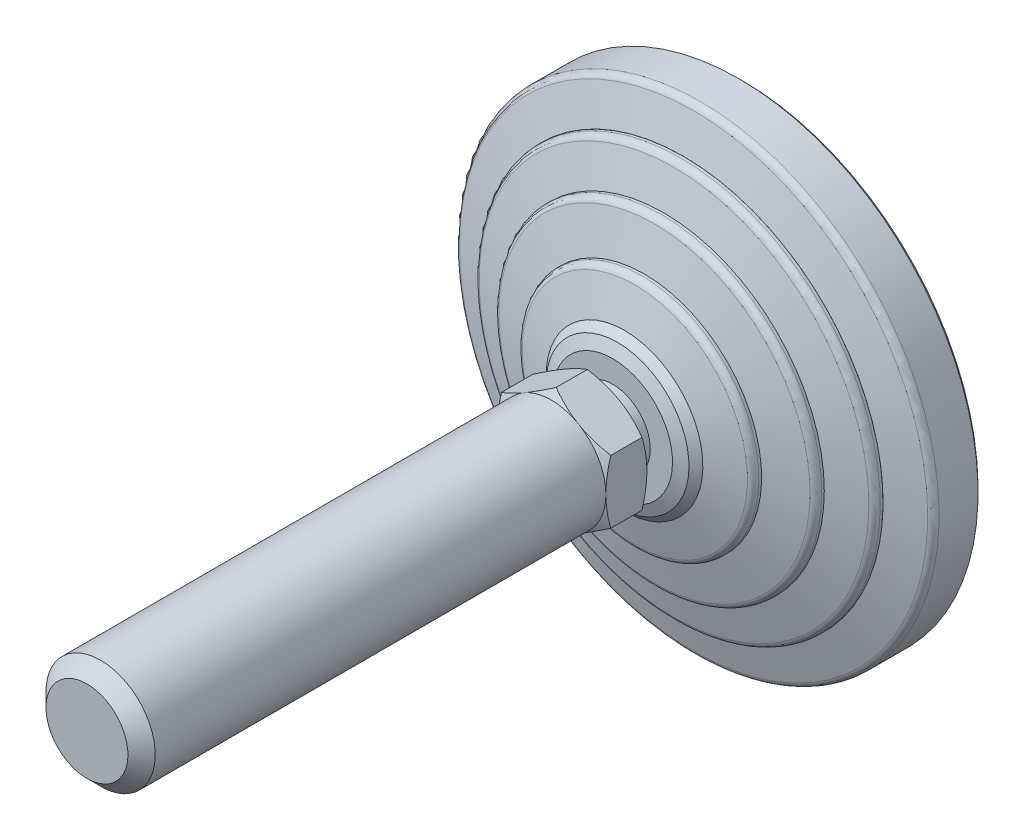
ISO-10303-21;
HEADER;
FILE_DESCRIPTION(('STEP AP214'),'2;1');
FILE_NAME('part.step','',(''),(''),'','','');
FILE_SCHEMA(('AUTOMOTIVE_DESIGN { 1 0 10303 214 1 1 1 1 }'));
ENDSEC;
DATA;
#1=APPLICATION_CONTEXT('core data for automotive mechanical design processes');
#2=APPLICATION_PROTOCOL_DEFINITION('international standard','automotive_design',2000,#1);
#3=PRODUCT_CONTEXT('',#1,'mechanical');
#4=PRODUCT('Part','Part','',(#3));
#5=PRODUCT_RELATED_PRODUCT_CATEGORY('part','',(#4));
#6=PRODUCT_DEFINITION_FORMATION('','',#4);
#7=PRODUCT_DEFINITION_CONTEXT('part definition',#1,'design');
#8=PRODUCT_DEFINITION('design','',#6,#7);
#9=PRODUCT_DEFINITION_SHAPE('','',#8);
#10=(LENGTH_UNIT() NAMED_UNIT(*) SI_UNIT(.MILLI.,.METRE.));
#11=(NAMED_UNIT(*) PLANE_ANGLE_UNIT() SI_UNIT($,.RADIAN.));
#12=(NAMED_UNIT(*) SI_UNIT($,.STERADIAN.) SOLID_ANGLE_UNIT());
#13=UNCERTAINTY_MEASURE_WITH_UNIT(LENGTH_MEASURE(1.E-05),#10,'distance_accuracy_value','');
#14=(GEOMETRIC_REPRESENTATION_CONTEXT(3) GLOBAL_UNCERTAINTY_ASSIGNED_CONTEXT((#13)) GLOBAL_UNIT_ASSIGNED_CONTEXT((#10,
#11,#12)) REPRESENTATION_CONTEXT('',''));
#15=CARTESIAN_POINT('',(0.,0.,0.));
#16=DIRECTION('',(0.,0.,1.));
#17=DIRECTION('',(1.,0.,0.));
#18=AXIS2_PLACEMENT_3D('',#15,#16,#17);
#19=CARTESIAN_POINT('',(-7.76470588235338,0.,21.9999999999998));
#20=DIRECTION('',(0.,0.,1.));
#21=DIRECTION('',(0.,-1.,0.));
#22=AXIS2_PLACEMENT_3D('',#19,#20,#21);
#23=PLANE('',#22);
#24=CARTESIAN_POINT('',(0.,0.,21.9999999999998));
#25=DIRECTION('',(0.,0.,-1.));
#26=DIRECTION('',(0.,1.,0.));
#27=AXIS2_PLACEMENT_3D('',#24,#25,#26);
#28=CIRCLE('',#27,5.50000000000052);
#29=CARTESIAN_POINT('',(0.,5.50000000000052,21.9999999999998));
#30=VERTEX_POINT('',#29);
#31=EDGE_CURVE('E338',#30,#30,#28,.T.);
#32=ORIENTED_EDGE('',*,*,#31,.F.);
#33=EDGE_LOOP('',(#32));
#34=FACE_BOUND('',#33,.T.);
#35=CARTESIAN_POINT('',(0.,0.,21.9999999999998));
#36=DIRECTION('',(0.,0.,-1.));
#37=DIRECTION('',(-1.,0.,0.));
#38=AXIS2_PLACEMENT_3D('',#35,#36,#37);
#39=CIRCLE('',#38,8.00000000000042);
#40=CARTESIAN_POINT('',(4.,6.92820323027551,21.9999999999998));
#41=VERTEX_POINT('',#40);
#42=CARTESIAN_POINT('',(8.,0.,21.9999999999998));
#43=VERTEX_POINT('',#42);
#44=EDGE_CURVE('E491',#41,#43,#39,.T.);
#45=ORIENTED_EDGE('',*,*,#44,.T.);
#46=CARTESIAN_POINT('',(4.,-6.92820323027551,21.9999999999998));
#47=VERTEX_POINT('',#46);
#48=EDGE_CURVE('E140',#43,#47,#39,.T.);
#49=ORIENTED_EDGE('',*,*,#48,.T.);
#50=CARTESIAN_POINT('',(-4.,-6.92820323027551,21.9999999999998));
#51=VERTEX_POINT('',#50);
#52=EDGE_CURVE('E139',#47,#51,#39,.T.);
#53=ORIENTED_EDGE('',*,*,#52,.T.);
#54=CARTESIAN_POINT('',(-8.,0.,21.9999999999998));
#55=VERTEX_POINT('',#54);
#56=EDGE_CURVE('E117',#51,#55,#39,.T.);
#57=ORIENTED_EDGE('',*,*,#56,.T.);
#58=CARTESIAN_POINT('',(-4.,6.92820323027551,21.9999999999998));
#59=VERTEX_POINT('',#58);
#60=EDGE_CURVE('E105',#55,#59,#39,.T.);
#61=ORIENTED_EDGE('',*,*,#60,.T.);
#62=EDGE_CURVE('E34',#59,#41,#39,.T.);
#63=ORIENTED_EDGE('',*,*,#62,.T.);
#64=EDGE_LOOP('',(#45,#49,#53,#57,#61,#63));
#65=FACE_BOUND('',#64,.T.);
#66=ADVANCED_FACE('F14',(#34,#65),#23,.F.);
#67=CARTESIAN_POINT('',(0.,0.,0.));
#68=DIRECTION('',(0.,0.,-1.));
#69=DIRECTION('',(0.,1.,0.));
#70=AXIS2_PLACEMENT_3D('',#67,#68,#69);
#71=CYLINDRICAL_SURFACE('',#70,5.50000000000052);
#72=CARTESIAN_POINT('',(0.,0.,19.));
#73=DIRECTION('',(0.,0.,-1.));
#74=DIRECTION('',(0.,1.,0.));
#75=AXIS2_PLACEMENT_3D('',#72,#73,#74);
#76=CIRCLE('',#75,5.50000000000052);
#77=CARTESIAN_POINT('',(0.,5.50000000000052,19.));
#78=VERTEX_POINT('',#77);
#79=EDGE_CURVE('E343',#78,#78,#76,.T.);
#80=ORIENTED_EDGE('',*,*,#79,.F.);
#81=EDGE_LOOP('',(#80));
#82=FACE_BOUND('',#81,.T.);
#83=ORIENTED_EDGE('',*,*,#31,.T.);
#84=EDGE_LOOP('',(#83));
#85=FACE_BOUND('',#84,.T.);
#86=ADVANCED_FACE('F305',(#82,#85),#71,.T.);
#87=CARTESIAN_POINT('',(-8.7540983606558,0.,19.));
#88=DIRECTION('',(0.,0.,-1.));
#89=DIRECTION('',(0.,1.,0.));
#90=AXIS2_PLACEMENT_3D('',#87,#88,#89);
#91=PLANE('',#90);
#92=CARTESIAN_POINT('',(0.,0.,19.));
#93=DIRECTION('',(0.,0.,-1.));
#94=DIRECTION('',(0.,1.,0.));
#95=AXIS2_PLACEMENT_3D('',#92,#93,#94);
#96=CIRCLE('',#95,8.7540983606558);
#97=CARTESIAN_POINT('',(0.,8.7540983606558,19.));
#98=VERTEX_POINT('',#97);
#99=EDGE_CURVE('E346',#98,#98,#96,.T.);
#100=ORIENTED_EDGE('',*,*,#99,.F.);
#101=EDGE_LOOP('',(#100));
#102=FACE_BOUND('',#101,.T.);
#103=ORIENTED_EDGE('',*,*,#79,.T.);
#104=EDGE_LOOP('',(#103));
#105=FACE_BOUND('',#104,.T.);
#106=ADVANCED_FACE('F301',(#102,#105),#91,.F.);
#107=CARTESIAN_POINT('',(0.,0.,19.));
#108=DIRECTION('',(0.,0.,-1.));
#109=DIRECTION('',(0.,1.,0.));
#110=AXIS2_PLACEMENT_3D('',#107,#108,#109);
#111=CONICAL_SURFACE('',#110,8.7540983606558,1.17809724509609);
#112=CARTESIAN_POINT('',(0.,0.,18.2928932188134));
#113=DIRECTION('',(0.,0.,-1.));
#114=DIRECTION('',(0.,1.,0.));
#115=AXIS2_PLACEMENT_3D('',#112,#113,#114);
#116=CIRCLE('',#115,10.4612051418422);
#117=CARTESIAN_POINT('',(0.,10.4612051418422,18.2928932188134));
#118=VERTEX_POINT('',#117);
#119=EDGE_CURVE('E349',#118,#118,#116,.T.);
#120=ORIENTED_EDGE('',*,*,#119,.F.);
#121=EDGE_LOOP('',(#120));
#122=FACE_BOUND('',#121,.T.);
#123=ORIENTED_EDGE('',*,*,#99,.T.);
#124=EDGE_LOOP('',(#123));
#125=FACE_BOUND('',#124,.T.);
#126=ADVANCED_FACE('F297',(#122,#125),#111,.T.);
#127=CARTESIAN_POINT('',(0.,0.,18.2928932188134));
#128=DIRECTION('',(0.,0.,-1.));
#129=DIRECTION('',(0.,1.,0.));
#130=AXIS2_PLACEMENT_3D('',#127,#128,#129);
#131=CONICAL_SURFACE('',#130,10.4612051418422,0.785398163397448);
#132=CARTESIAN_POINT('',(0.,0.,17.27868852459));
#133=DIRECTION('',(0.,0.,-1.));
#134=DIRECTION('',(0.,1.,0.));
#135=AXIS2_PLACEMENT_3D('',#132,#133,#134);
#136=CIRCLE('',#135,11.4754098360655);
#137=CARTESIAN_POINT('',(0.,11.4754098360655,17.27868852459));
#138=VERTEX_POINT('',#137);
#139=EDGE_CURVE('E352',#138,#138,#136,.T.);
#140=ORIENTED_EDGE('',*,*,#139,.F.);
#141=EDGE_LOOP('',(#140));
#142=FACE_BOUND('',#141,.T.);
#143=ORIENTED_EDGE('',*,*,#119,.T.);
#144=EDGE_LOOP('',(#143));
#145=FACE_BOUND('',#144,.T.);
#146=ADVANCED_FACE('F293',(#142,#145),#131,.T.);
#147=CARTESIAN_POINT('',(0.,0.,17.27868852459));
#148=DIRECTION('',(0.,0.,-1.));
#149=DIRECTION('',(0.,1.,0.));
#150=AXIS2_PLACEMENT_3D('',#147,#148,#149);
#151=CONICAL_SURFACE('',#150,11.4754098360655,1.27933953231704);
#152=CARTESIAN_POINT('',(0.,0.,15.7711726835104));
#153=DIRECTION('',(0.,0.,-1.));
#154=DIRECTION('',(0.,1.,0.));
#155=AXIS2_PLACEMENT_3D('',#152,#153,#154);
#156=CIRCLE('',#155,16.5004626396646);
#157=CARTESIAN_POINT('',(0.,16.5004626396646,15.7711726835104));
#158=VERTEX_POINT('',#157);
#159=EDGE_CURVE('E355',#158,#158,#156,.T.);
#160=ORIENTED_EDGE('',*,*,#159,.F.);
#161=EDGE_LOOP('',(#160));
#162=FACE_BOUND('',#161,.T.);
#163=ORIENTED_EDGE('',*,*,#139,.T.);
#164=EDGE_LOOP('',(#163));
#165=FACE_BOUND('',#164,.T.);
#166=ADVANCED_FACE('F289',(#162,#165),#151,.T.);
#167=CARTESIAN_POINT('',(0.,0.,14.8133463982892));
#168=DIRECTION('',(0.,0.,-1.));
#169=DIRECTION('',(0.,1.,0.));
#170=AXIS2_PLACEMENT_3D('',#167,#168,#169);
#171=TOROIDAL_SURFACE('',#170,16.2131147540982,1.);
#172=CARTESIAN_POINT('',(0.,0.,14.8133463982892));
#173=DIRECTION('',(0.,0.,-1.));
#174=DIRECTION('',(0.,1.,0.));
#175=AXIS2_PLACEMENT_3D('',#172,#173,#174);
#176=CIRCLE('',#175,17.2131147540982);
#177=CARTESIAN_POINT('',(0.,17.2131147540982,14.8133463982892));
#178=VERTEX_POINT('',#177);
#179=EDGE_CURVE('E358',#178,#178,#176,.T.);
#180=ORIENTED_EDGE('',*,*,#179,.F.);
#181=EDGE_LOOP('',(#180));
#182=FACE_BOUND('',#181,.T.);
#183=ORIENTED_EDGE('',*,*,#159,.T.);
#184=EDGE_LOOP('',(#183));
#185=FACE_BOUND('',#184,.T.);
#186=ADVANCED_FACE('F285',(#182,#185),#171,.T.);
#187=CARTESIAN_POINT('',(0.,0.,0.));
#188=DIRECTION('',(0.,0.,-1.));
#189=DIRECTION('',(0.,1.,0.));
#190=AXIS2_PLACEMENT_3D('',#187,#188,#189);
#191=CYLINDRICAL_SURFACE('',#190,17.2131147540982);
#192=CARTESIAN_POINT('',(0.,0.,14.4098360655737));
#193=DIRECTION('',(0.,0.,-1.));
#194=DIRECTION('',(0.,1.,0.));
#195=AXIS2_PLACEMENT_3D('',#192,#193,#194);
#196=CIRCLE('',#195,17.2131147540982);
#197=CARTESIAN_POINT('',(0.,17.2131147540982,14.4098360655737));
#198=VERTEX_POINT('',#197);
#199=EDGE_CURVE('E361',#198,#198,#196,.T.);
#200=ORIENTED_EDGE('',*,*,#199,.F.);
#201=EDGE_LOOP('',(#200));
#202=FACE_BOUND('',#201,.T.);
#203=ORIENTED_EDGE('',*,*,#179,.T.);
#204=EDGE_LOOP('',(#203));
#205=FACE_BOUND('',#204,.T.);
#206=ADVANCED_FACE('F281',(#202,#205),#191,.T.);
#207=CARTESIAN_POINT('',(0.,0.,14.4098360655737));
#208=DIRECTION('',(0.,0.,-1.));
#209=DIRECTION('',(0.,1.,0.));
#210=AXIS2_PLACEMENT_3D('',#207,#208,#209);
#211=CONICAL_SURFACE('',#210,17.2131147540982,1.30454427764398);
#212=CARTESIAN_POINT('',(0.,0.,12.8894925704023));
#213=DIRECTION('',(0.,0.,-1.));
#214=DIRECTION('',(0.,1.,0.));
#215=AXIS2_PLACEMENT_3D('',#212,#213,#214);
#216=CIRCLE('',#215,22.7877075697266);
#217=CARTESIAN_POINT('',(0.,22.7877075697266,12.8894925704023));
#218=VERTEX_POINT('',#217);
#219=EDGE_CURVE('E364',#218,#218,#216,.T.);
#220=ORIENTED_EDGE('',*,*,#219,.F.);
#221=EDGE_LOOP('',(#220));
#222=FACE_BOUND('',#221,.T.);
#223=ORIENTED_EDGE('',*,*,#199,.T.);
#224=EDGE_LOOP('',(#223));
#225=FACE_BOUND('',#224,.T.);
#226=ADVANCED_FACE('F277',(#222,#225),#211,.T.);
#227=CARTESIAN_POINT('',(0.,0.,11.9247287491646));
#228=DIRECTION('',(0.,0.,-1.));
#229=DIRECTION('',(0.,1.,0.));
#230=AXIS2_PLACEMENT_3D('',#227,#228,#229);
#231=TOROIDAL_SURFACE('',#230,22.5245901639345,1.);
#232=CARTESIAN_POINT('',(0.,0.,11.9247287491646));
#233=DIRECTION('',(0.,0.,-1.));
#234=DIRECTION('',(0.,1.,0.));
#235=AXIS2_PLACEMENT_3D('',#232,#233,#234);
#236=CIRCLE('',#235,23.5245901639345);
#237=CARTESIAN_POINT('',(0.,23.5245901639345,11.9247287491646));
#238=VERTEX_POINT('',#237);
#239=EDGE_CURVE('E367',#238,#238,#236,.T.);
#240=ORIENTED_EDGE('',*,*,#239,.F.);
#241=EDGE_LOOP('',(#240));
#242=FACE_BOUND('',#241,.T.);
#243=ORIENTED_EDGE('',*,*,#219,.T.);
#244=EDGE_LOOP('',(#243));
#245=FACE_BOUND('',#244,.T.);
#246=ADVANCED_FACE('F273',(#242,#245),#231,.T.);
#247=CARTESIAN_POINT('',(0.,0.,0.));
#248=DIRECTION('',(0.,0.,-1.));
#249=DIRECTION('',(0.,1.,0.));
#250=AXIS2_PLACEMENT_3D('',#247,#248,#249);
#251=CYLINDRICAL_SURFACE('',#250,23.5245901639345);
#252=CARTESIAN_POINT('',(0.,0.,11.5409836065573));
#253=DIRECTION('',(0.,0.,-1.));
#254=DIRECTION('',(0.,1.,0.));
#255=AXIS2_PLACEMENT_3D('',#252,#253,#254);
#256=CIRCLE('',#255,23.5245901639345);
#257=CARTESIAN_POINT('',(0.,23.5245901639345,11.5409836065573));
#258=VERTEX_POINT('',#257);
#259=EDGE_CURVE('E370',#258,#258,#256,.T.);
#260=ORIENTED_EDGE('',*,*,#259,.F.);
#261=EDGE_LOOP('',(#260));
#262=FACE_BOUND('',#261,.T.);
#263=ORIENTED_EDGE('',*,*,#239,.T.);
#264=EDGE_LOOP('',(#263));
#265=FACE_BOUND('',#264,.T.);
#266=ADVANCED_FACE('F269',(#262,#265),#251,.T.);
#267=CARTESIAN_POINT('',(0.,0.,11.5409836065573));
#268=DIRECTION('',(0.,0.,-1.));
#269=DIRECTION('',(0.,1.,0.));
#270=AXIS2_PLACEMENT_3D('',#267,#268,#269);
#271=CONICAL_SURFACE('',#270,23.5245901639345,1.27871257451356);
#272=CARTESIAN_POINT('',(0.,0.,10.0337743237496));
#273=DIRECTION('',(0.,0.,-1.));
#274=DIRECTION('',(0.,1.,0.));
#275=AXIS2_PLACEMENT_3D('',#272,#273,#274);
#276=CIRCLE('',#275,28.5372004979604);
#277=CARTESIAN_POINT('',(0.,28.5372004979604,10.0337743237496));
#278=VERTEX_POINT('',#277);
#279=EDGE_CURVE('E373',#278,#278,#276,.T.);
#280=ORIENTED_EDGE('',*,*,#279,.F.);
#281=EDGE_LOOP('',(#280));
#282=FACE_BOUND('',#281,.T.);
#283=ORIENTED_EDGE('',*,*,#259,.T.);
#284=EDGE_LOOP('',(#283));
#285=FACE_BOUND('',#284,.T.);
#286=ADVANCED_FACE('F265',(#282,#285),#271,.T.);
#287=CARTESIAN_POINT('',(0.,0.,9.07612838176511));
#288=DIRECTION('',(0.,0.,-1.));
#289=DIRECTION('',(0.,1.,0.));
#290=AXIS2_PLACEMENT_3D('',#287,#288,#289);
#291=TOROIDAL_SURFACE('',#290,28.2492521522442,1.);
#292=CARTESIAN_POINT('',(0.,0.,9.07612838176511));
#293=DIRECTION('',(0.,0.,-1.));
#294=DIRECTION('',(0.,1.,0.));
#295=AXIS2_PLACEMENT_3D('',#292,#293,#294);
#296=CIRCLE('',#295,29.2492521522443);
#297=CARTESIAN_POINT('',(0.,29.2492521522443,9.07612838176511));
#298=VERTEX_POINT('',#297);
#299=EDGE_CURVE('E376',#298,#298,#296,.T.);
#300=ORIENTED_EDGE('',*,*,#299,.F.);
#301=EDGE_LOOP('',(#300));
#302=FACE_BOUND('',#301,.T.);
#303=ORIENTED_EDGE('',*,*,#279,.T.);
#304=EDGE_LOOP('',(#303));
#305=FACE_BOUND('',#304,.T.);
#306=ADVANCED_FACE('F261',(#302,#305),#291,.T.);
#307=CARTESIAN_POINT('',(0.,0.,0.));
#308=DIRECTION('',(0.,0.,-1.));
#309=DIRECTION('',(0.,1.,0.));
#310=AXIS2_PLACEMENT_3D('',#307,#308,#309);
#311=CYLINDRICAL_SURFACE('',#310,29.2492521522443);
#312=CARTESIAN_POINT('',(0.,0.,8.67213114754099));
#313=DIRECTION('',(0.,0.,-1.));
#314=DIRECTION('',(0.,1.,0.));
#315=AXIS2_PLACEMENT_3D('',#312,#313,#314);
#316=CIRCLE('',#315,29.2492521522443);
#317=CARTESIAN_POINT('',(0.,29.2492521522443,8.67213114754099));
#318=VERTEX_POINT('',#317);
#319=EDGE_CURVE('E379',#318,#318,#316,.T.);
#320=ORIENTED_EDGE('',*,*,#319,.F.);
#321=EDGE_LOOP('',(#320));
#322=FACE_BOUND('',#321,.T.);
#323=ORIENTED_EDGE('',*,*,#299,.T.);
#324=EDGE_LOOP('',(#323));
#325=FACE_BOUND('',#324,.T.);
#326=ADVANCED_FACE('F257',(#322,#325),#311,.T.);
#327=CARTESIAN_POINT('',(-29.2622950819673,0.,8.67213114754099));
#328=DIRECTION('',(0.,0.,-1.));
#329=DIRECTION('',(0.,1.,0.));
#330=AXIS2_PLACEMENT_3D('',#327,#328,#329);
#331=PLANE('',#330);
#332=CARTESIAN_POINT('',(0.,0.,8.67213114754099));
#333=DIRECTION('',(0.,0.,-1.));
#334=DIRECTION('',(0.,1.,0.));
#335=AXIS2_PLACEMENT_3D('',#332,#333,#334);
#336=CIRCLE('',#335,29.2622950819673);
#337=CARTESIAN_POINT('',(0.,29.2622950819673,8.67213114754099));
#338=VERTEX_POINT('',#337);
#339=EDGE_CURVE('E382',#338,#338,#336,.T.);
#340=ORIENTED_EDGE('',*,*,#339,.F.);
#341=EDGE_LOOP('',(#340));
#342=FACE_BOUND('',#341,.T.);
#343=ORIENTED_EDGE('',*,*,#319,.T.);
#344=EDGE_LOOP('',(#343));
#345=FACE_BOUND('',#344,.T.);
#346=ADVANCED_FACE('F253',(#342,#345),#331,.F.);
#347=CARTESIAN_POINT('',(0.,0.,8.67213114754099));
#348=DIRECTION('',(0.,0.,-1.));
#349=DIRECTION('',(0.,1.,0.));
#350=AXIS2_PLACEMENT_3D('',#347,#348,#349);
#351=CONICAL_SURFACE('',#350,29.2622950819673,1.27933953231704);
#352=CARTESIAN_POINT('',(0.,0.,7.16461530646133));
#353=DIRECTION('',(0.,0.,-1.));
#354=DIRECTION('',(0.,1.,0.));
#355=AXIS2_PLACEMENT_3D('',#352,#353,#354);
#356=CIRCLE('',#355,34.2873478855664);
#357=CARTESIAN_POINT('',(0.,34.2873478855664,7.16461530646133));
#358=VERTEX_POINT('',#357);
#359=EDGE_CURVE('E385',#358,#358,#356,.T.);
#360=ORIENTED_EDGE('',*,*,#359,.F.);
#361=EDGE_LOOP('',(#360));
#362=FACE_BOUND('',#361,.T.);
#363=ORIENTED_EDGE('',*,*,#339,.T.);
#364=EDGE_LOOP('',(#363));
#365=FACE_BOUND('',#364,.T.);
#366=ADVANCED_FACE('F249',(#362,#365),#351,.T.);
#367=CARTESIAN_POINT('',(0.,0.,6.20678902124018));
#368=DIRECTION('',(0.,0.,-1.));
#369=DIRECTION('',(0.,1.,0.));
#370=AXIS2_PLACEMENT_3D('',#367,#368,#369);
#371=TOROIDAL_SURFACE('',#370,34.,1.);
#372=CARTESIAN_POINT('',(0.,0.,6.20678902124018));
#373=DIRECTION('',(0.,0.,-1.));
#374=DIRECTION('',(0.,1.,0.));
#375=AXIS2_PLACEMENT_3D('',#372,#373,#374);
#376=CIRCLE('',#375,35.);
#377=CARTESIAN_POINT('',(0.,35.,6.20678902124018));
#378=VERTEX_POINT('',#377);
#379=EDGE_CURVE('E388',#378,#378,#376,.T.);
#380=ORIENTED_EDGE('',*,*,#379,.F.);
#381=EDGE_LOOP('',(#380));
#382=FACE_BOUND('',#381,.T.);
#383=ORIENTED_EDGE('',*,*,#359,.T.);
#384=EDGE_LOOP('',(#383));
#385=FACE_BOUND('',#384,.T.);
#386=ADVANCED_FACE('F245',(#382,#385),#371,.T.);
#387=CARTESIAN_POINT('',(0.,0.,0.));
#388=DIRECTION('',(0.,0.,-1.));
#389=DIRECTION('',(0.,1.,0.));
#390=AXIS2_PLACEMENT_3D('',#387,#388,#389);
#391=CYLINDRICAL_SURFACE('',#390,35.);
#392=CARTESIAN_POINT('',(0.,0.,0.5));
#393=DIRECTION('',(0.,0.,-1.));
#394=DIRECTION('',(0.,1.,0.));
#395=AXIS2_PLACEMENT_3D('',#392,#393,#394);
#396=CIRCLE('',#395,35.);
#397=CARTESIAN_POINT('',(0.,35.,0.5));
#398=VERTEX_POINT('',#397);
#399=EDGE_CURVE('E391',#398,#398,#396,.T.);
#400=ORIENTED_EDGE('',*,*,#399,.F.);
#401=EDGE_LOOP('',(#400));
#402=FACE_BOUND('',#401,.T.);
#403=ORIENTED_EDGE('',*,*,#379,.T.);
#404=EDGE_LOOP('',(#403));
#405=FACE_BOUND('',#404,.T.);
#406=ADVANCED_FACE('F241',(#402,#405),#391,.T.);
#407=CARTESIAN_POINT('',(0.,0.,0.5));
#408=DIRECTION('',(0.,0.,1.));
#409=DIRECTION('',(0.,-1.,0.));
#410=AXIS2_PLACEMENT_3D('',#407,#408,#409);
#411=CONICAL_SURFACE('',#410,35.,0.785398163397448);
#412=CARTESIAN_POINT('',(0.,0.,0.));
#413=DIRECTION('',(0.,0.,-1.));
#414=DIRECTION('',(0.,1.,0.));
#415=AXIS2_PLACEMENT_3D('',#412,#413,#414);
#416=CIRCLE('',#415,34.5);
#417=CARTESIAN_POINT('',(0.,34.5,0.));
#418=VERTEX_POINT('',#417);
#419=EDGE_CURVE('E394',#418,#418,#416,.T.);
#420=ORIENTED_EDGE('',*,*,#419,.F.);
#421=EDGE_LOOP('',(#420));
#422=FACE_BOUND('',#421,.T.);
#423=ORIENTED_EDGE('',*,*,#399,.T.);
#424=EDGE_LOOP('',(#423));
#425=FACE_BOUND('',#424,.T.);
#426=ADVANCED_FACE('F237',(#422,#425),#411,.T.);
#427=CARTESIAN_POINT('',(-34.5,0.,0.));
#428=DIRECTION('',(0.,0.,1.));
#429=DIRECTION('',(0.,-1.,0.));
#430=AXIS2_PLACEMENT_3D('',#427,#428,#429);
#431=PLANE('',#430);
#432=ORIENTED_EDGE('',*,*,#419,.T.);
#433=EDGE_LOOP('',(#432));
#434=FACE_BOUND('',#433,.T.);
#435=ADVANCED_FACE('F233',(#434),#431,.F.);
#436=CARTESIAN_POINT('',(0.,0.,23.6518067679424));
#437=DIRECTION('',(0.,0.,1.));
#438=DIRECTION('',(1.,0.,0.));
#439=AXIS2_PLACEMENT_3D('',#436,#437,#438);
#440=CONICAL_SURFACE('',#439,10.8610132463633,1.0471975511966);
#441=CARTESIAN_POINT('',(8.,-12.3802245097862,25.8913870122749));
#442=CARTESIAN_POINT('',(8.,-12.0310392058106,25.722107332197));
#443=CARTESIAN_POINT('',(8.,-11.6810494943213,25.5544584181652));
#444=CARTESIAN_POINT('',(8.,-10.9790333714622,25.2233398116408));
#445=CARTESIAN_POINT('',(8.,-10.6270066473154,25.0598707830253));
#446=CARTESIAN_POINT('',(8.,-9.9186620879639,24.7372015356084));
#447=CARTESIAN_POINT('',(8.,-9.56233130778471,24.5780296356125));
#448=CARTESIAN_POINT('',(8.,-8.84682647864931,24.2662349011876));
#449=CARTESIAN_POINT('',(8.,-8.48765256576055,24.1136117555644));
#450=CARTESIAN_POINT('',(8.,-7.75438544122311,23.8119108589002));
#451=CARTESIAN_POINT('',(8.,-7.3801814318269,23.6631008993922));
#452=CARTESIAN_POINT('',(8.,-6.62738658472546,23.3768075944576));
#453=CARTESIAN_POINT('',(8.,-6.24879525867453,23.2393255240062));
#454=CARTESIAN_POINT('',(8.,-5.4873361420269,22.9793170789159));
#455=CARTESIAN_POINT('',(8.,-5.10447888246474,22.8567601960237));
#456=CARTESIAN_POINT('',(8.,-4.33328636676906,22.6305506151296));
#457=CARTESIAN_POINT('',(8.,-3.94495288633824,22.5268919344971));
#458=CARTESIAN_POINT('',(8.,-3.16468038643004,22.3440294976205));
#459=CARTESIAN_POINT('',(8.,-2.7727731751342,22.2646936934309));
#460=CARTESIAN_POINT('',(8.,-2.18136468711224,22.1673783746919));
#461=CARTESIAN_POINT('',(8.,-1.98362248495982,22.1385533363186));
#462=CARTESIAN_POINT('',(8.,-1.58716421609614,22.0886987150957));
#463=CARTESIAN_POINT('',(8.,-1.38844824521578,22.0676683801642));
#464=CARTESIAN_POINT('',(8.,-0.992892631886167,22.0340844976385));
#465=CARTESIAN_POINT('',(8.,-0.796062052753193,22.0214246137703));
#466=CARTESIAN_POINT('',(8.,-0.402042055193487,22.0044379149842));
#467=CARTESIAN_POINT('',(8.,-0.204852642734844,22.0001109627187));
#468=CARTESIAN_POINT('',(8.,0.189532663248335,21.9998932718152));
#469=CARTESIAN_POINT('',(8.,0.386728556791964,22.0040025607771));
#470=CARTESIAN_POINT('',(8.,0.780772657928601,22.0205573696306));
#471=CARTESIAN_POINT('',(8.,0.97762084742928,22.0330033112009));
#472=CARTESIAN_POINT('',(8.,1.45152341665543,22.0727391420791));
#473=CARTESIAN_POINT('',(8.,1.72824932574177,22.1040298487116));
#474=CARTESIAN_POINT('',(8.,2.27961674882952,22.1813729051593));
#475=CARTESIAN_POINT('',(8.,2.55425797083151,22.2274272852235));
#476=CARTESIAN_POINT('',(8.,3.37475867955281,22.3852912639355));
#477=CARTESIAN_POINT('',(8.,3.91688182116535,22.5167719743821));
#478=CARTESIAN_POINT('',(8.,4.72743961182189,22.7443831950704));
#479=CARTESIAN_POINT('',(8.,5.00008877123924,22.8263651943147));
#480=CARTESIAN_POINT('',(8.,5.54273839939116,22.998748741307));
#481=CARTESIAN_POINT('',(8.,5.81273885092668,23.0891503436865));
#482=CARTESIAN_POINT('',(8.,6.35017757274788,23.2769306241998));
#483=CARTESIAN_POINT('',(8.,6.61761667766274,23.3743069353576));
#484=CARTESIAN_POINT('',(8.,7.15028581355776,23.5749004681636));
#485=CARTESIAN_POINT('',(8.,7.41551586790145,23.6781176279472));
#486=CARTESIAN_POINT('',(8.,8.03092579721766,23.9241714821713));
#487=CARTESIAN_POINT('',(8.,8.38035793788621,24.0688746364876));
#488=CARTESIAN_POINT('',(8.,9.07632968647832,24.36509671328));
#489=CARTESIAN_POINT('',(8.,9.42286913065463,24.5166160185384));
#490=CARTESIAN_POINT('',(8.,10.1135728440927,24.825132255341));
#491=CARTESIAN_POINT('',(8.,10.4577366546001,24.9821302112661));
#492=CARTESIAN_POINT('',(8.,11.1440236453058,25.3005323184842));
#493=CARTESIAN_POINT('',(8.,11.4861467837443,25.4619365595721));
#494=CARTESIAN_POINT('',(8.,12.1690185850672,25.7885037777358));
#495=CARTESIAN_POINT('',(8.,12.5097654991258,25.9536704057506));
#496=CARTESIAN_POINT('',(8.,13.1898033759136,26.286976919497));
#497=CARTESIAN_POINT('',(8.,13.5290943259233,26.4551168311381));
#498=CARTESIAN_POINT('',(8.,14.545039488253,26.9631789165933));
#499=CARTESIAN_POINT('',(8.,15.2198514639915,27.3067846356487));
#500=CARTESIAN_POINT('',(8.,16.511118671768,27.9727078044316));
#501=CARTESIAN_POINT('',(8.,17.1278549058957,28.2944827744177));
#502=CARTESIAN_POINT('',(8.,18.3590134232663,28.9424750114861));
#503=CARTESIAN_POINT('',(8.,18.9734356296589,29.2686924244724));
#504=CARTESIAN_POINT('',(8.,20.1990020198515,29.9237385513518));
#505=CARTESIAN_POINT('',(8.,20.8101505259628,30.2525591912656));
#506=CARTESIAN_POINT('',(8.,22.0309613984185,30.9128721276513));
#507=CARTESIAN_POINT('',(8.,22.6406238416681,31.2443642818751));
#508=CARTESIAN_POINT('',(8.,23.2497362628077,31.5768572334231));
#509=B_SPLINE_CURVE_WITH_KNOTS('',3,(#441,#442,#443,#444,#445,#446,#447,#448,#449,#450,#451,
#452,#453,#454,#455,#456,#457,#458,#459,#460,#461,#462,#463,#464,#465,#466,#467,#468,#469,#470,
#471,#472,#473,#474,#475,#476,#477,#478,#479,#480,#481,#482,#483,#484,#485,#486,#487,#488,#489,
#490,#491,#492,#493,#494,#495,#496,#497,#498,#499,#500,#501,#502,#503,#504,#505,#506,#507,#508),
.UNSPECIFIED.,.F.,.F.,(4,2,2,2,2,2,2,2,2,2,2,2,2,2,2,2,2,2,2,2,2,2,2,2,2,2,2,2,2,2,2,2,2,4),(0.,
1.16417664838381,2.32853706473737,3.49928138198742,4.66997000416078,5.87794914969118,
7.08606407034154,8.29166651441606,9.49688663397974,10.6954428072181,11.2948095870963,
11.8941185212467,12.4856597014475,13.0771911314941,13.668724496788,14.2602877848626,
15.0952834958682,15.9303940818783,17.601555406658,18.4556091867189,19.309668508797,
20.1634393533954,21.0172011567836,22.1517310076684,23.2863246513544,24.4211315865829,
25.5559616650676,26.6919442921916,27.8279368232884,30.0996373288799,32.186511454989,
34.2734542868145,36.3554245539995,38.437284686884),.UNSPECIFIED.);
#510=CARTESIAN_POINT('',(8.,4.61880215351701,22.7145311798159));
#511=VERTEX_POINT('',#510);
#512=EDGE_CURVE('E115',#511,#43,#509,.F.);
#513=ORIENTED_EDGE('',*,*,#512,.T.);
#514=ORIENTED_EDGE('',*,*,#44,.F.);
#515=CARTESIAN_POINT('',(-0.000199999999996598,9.23771977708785,22.7145978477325));
#516=CARTESIAN_POINT('',(0.175648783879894,9.13619343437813,22.6559907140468));
#517=CARTESIAN_POINT('',(0.35215319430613,9.03428856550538,22.6000434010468));
#518=CARTESIAN_POINT('',(0.706595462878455,8.82965122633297,22.4942010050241));
#519=CARTESIAN_POINT('',(0.884533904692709,8.72691841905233,22.4443085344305));
#520=CARTESIAN_POINT('',(1.42119823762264,8.41707512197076,22.3046927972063));
#521=CARTESIAN_POINT('',(1.78204258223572,8.20874154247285,22.2252811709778));
#522=CARTESIAN_POINT('',(2.32203917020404,7.89697436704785,22.132161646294));
#523=CARTESIAN_POINT('',(2.49957818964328,7.79447216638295,22.1056345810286));
#524=CARTESIAN_POINT('',(2.85545911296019,7.58900421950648,22.0611531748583));
#525=CARTESIAN_POINT('',(3.03380094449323,7.48603851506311,22.0431980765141));
#526=CARTESIAN_POINT('',(3.39079168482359,7.27992981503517,22.0163156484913));
#527=CARTESIAN_POINT('',(3.5694400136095,7.17678715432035,22.0073780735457));
#528=CARTESIAN_POINT('',(3.92690170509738,6.97040655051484,21.9987223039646));
#529=CARTESIAN_POINT('',(4.10571506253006,6.86716861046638,21.9990038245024));
#530=CARTESIAN_POINT('',(4.44001336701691,6.67416139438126,22.0081450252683));
#531=CARTESIAN_POINT('',(4.59552190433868,6.58437849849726,22.0158896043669));
#532=CARTESIAN_POINT('',(4.90617476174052,6.40502298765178,22.0382011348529));
#533=CARTESIAN_POINT('',(5.06131905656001,6.31545038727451,22.0527685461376));
#534=CARTESIAN_POINT('',(5.52615131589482,6.04707935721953,22.106360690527));
#535=CARTESIAN_POINT('',(5.83501648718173,5.86875596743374,22.1552686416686));
#536=CARTESIAN_POINT('',(6.45602322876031,5.51021755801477,22.2775394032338));
#537=CARTESIAN_POINT('',(6.76808554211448,5.3300482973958,22.3514205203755));
#538=CARTESIAN_POINT('',(7.38755648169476,4.97239658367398,22.5191001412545));
#539=CARTESIAN_POINT('',(7.69497304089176,4.79490955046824,22.612859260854));
#540=CARTESIAN_POINT('',(8.0002,4.61868668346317,22.7145978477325));
#541=B_SPLINE_CURVE_WITH_KNOTS('',3,(#515,#516,#517,#518,#519,#520,#521,#522,#523,#524,#525,
#526,#527,#528,#529,#530,#531,#532,#533,#534,#535,#536,#537,#538,#539,#540),.UNSPECIFIED.,.F.,
.F.,(4,2,2,2,2,2,2,2,2,2,2,2,4),(0.,0.633973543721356,1.26821965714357,2.53934712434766,
3.15934343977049,3.77928496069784,4.39852133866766,5.01773858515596,5.5568023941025,
6.09590254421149,7.17487077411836,8.27776850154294,9.37850115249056),.UNSPECIFIED.);
#542=EDGE_CURVE('E18',#41,#511,#541,.T.);
#543=ORIENTED_EDGE('',*,*,#542,.T.);
#544=EDGE_LOOP('',(#513,#514,#543));
#545=FACE_BOUND('',#544,.T.);
#546=ADVANCED_FACE('F157',(#545),#440,.T.);
#547=CARTESIAN_POINT('',(-8.0002,4.61868668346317,22.7145978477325));
#548=CARTESIAN_POINT('',(-7.82435121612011,4.72021302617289,22.6559907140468));
#549=CARTESIAN_POINT('',(-7.64784680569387,4.82211789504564,22.6000434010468));
#550=CARTESIAN_POINT('',(-7.29340453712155,5.02675523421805,22.4942010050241));
#551=CARTESIAN_POINT('',(-7.1154660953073,5.12948804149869,22.4443085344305));
#552=CARTESIAN_POINT('',(-6.57880176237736,5.43933133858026,22.3046927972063));
#553=CARTESIAN_POINT('',(-6.21795741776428,5.64766491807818,22.2252811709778));
#554=CARTESIAN_POINT('',(-5.67796082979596,5.95943209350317,22.132161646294));
#555=CARTESIAN_POINT('',(-5.50042181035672,6.06193429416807,22.1056345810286));
#556=CARTESIAN_POINT('',(-5.14454088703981,6.26740224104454,22.0611531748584));
#557=CARTESIAN_POINT('',(-4.96619905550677,6.37036794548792,22.0431980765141));
#558=CARTESIAN_POINT('',(-4.60920831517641,6.57647664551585,22.0163156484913));
#559=CARTESIAN_POINT('',(-4.4305599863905,6.67961930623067,22.0073780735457));
#560=CARTESIAN_POINT('',(-4.07309829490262,6.88599991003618,21.9987223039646));
#561=CARTESIAN_POINT('',(-3.89428493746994,6.98923785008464,21.9990038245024));
#562=CARTESIAN_POINT('',(-3.5599866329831,7.18224506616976,22.0081450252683));
#563=CARTESIAN_POINT('',(-3.40447809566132,7.27202796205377,22.0158896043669));
#564=CARTESIAN_POINT('',(-3.09382523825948,7.45138347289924,22.0382011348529));
#565=CARTESIAN_POINT('',(-2.93868094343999,7.54095607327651,22.0527685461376));
#566=CARTESIAN_POINT('',(-2.47384868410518,7.80932710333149,22.106360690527));
#567=CARTESIAN_POINT('',(-2.16498351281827,7.98765049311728,22.1552686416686));
#568=CARTESIAN_POINT('',(-1.54397677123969,8.34618890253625,22.2775394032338));
#569=CARTESIAN_POINT('',(-1.23191445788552,8.52635816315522,22.3514205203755));
#570=CARTESIAN_POINT('',(-0.612443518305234,8.88400987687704,22.5191001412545));
#571=CARTESIAN_POINT('',(-0.305026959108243,9.06149691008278,22.612859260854));
#572=CARTESIAN_POINT('',(0.000200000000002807,9.23771977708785,22.7145978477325));
#573=B_SPLINE_CURVE_WITH_KNOTS('',3,(#547,#548,#549,#550,#551,#552,#553,#554,#555,#556,#557,
#558,#559,#560,#561,#562,#563,#564,#565,#566,#567,#568,#569,#570,#571,#572),.UNSPECIFIED.,.F.,
.F.,(4,2,2,2,2,2,2,2,2,2,2,2,4),(0.,0.633973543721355,1.26821965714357,2.53934712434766,
3.15934343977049,3.77928496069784,4.39852133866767,5.01773858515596,5.5568023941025,
6.0959025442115,7.17487077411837,8.27776850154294,9.37850115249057),.UNSPECIFIED.);
#574=CARTESIAN_POINT('',(0.,9.23760430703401,22.7145311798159));
#575=VERTEX_POINT('',#574);
#576=EDGE_CURVE('E149',#59,#575,#573,.T.);
#577=ORIENTED_EDGE('',*,*,#576,.T.);
#578=EDGE_CURVE('E9',#575,#41,#541,.T.);
#579=ORIENTED_EDGE('',*,*,#578,.T.);
#580=ORIENTED_EDGE('',*,*,#62,.F.);
#581=EDGE_LOOP('',(#577,#579,#580));
#582=FACE_BOUND('',#581,.T.);
#583=ADVANCED_FACE('F484',(#582),#440,.T.);
#584=CARTESIAN_POINT('',(8.0002,-4.61868668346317,22.7145978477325));
#585=CARTESIAN_POINT('',(7.82435121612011,-4.72021302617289,22.6559907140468));
#586=CARTESIAN_POINT('',(7.64784680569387,-4.82211789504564,22.6000434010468));
#587=CARTESIAN_POINT('',(7.29340453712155,-5.02675523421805,22.4942010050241));
#588=CARTESIAN_POINT('',(7.1154660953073,-5.12948804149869,22.4443085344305));
#589=CARTESIAN_POINT('',(6.57880176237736,-5.43933133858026,22.3046927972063));
#590=CARTESIAN_POINT('',(6.21795741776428,-5.64766491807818,22.2252811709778));
#591=CARTESIAN_POINT('',(5.67796082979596,-5.95943209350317,22.132161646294));
#592=CARTESIAN_POINT('',(5.50042181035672,-6.06193429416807,22.1056345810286));
#593=CARTESIAN_POINT('',(5.14454088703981,-6.26740224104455,22.0611531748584));
#594=CARTESIAN_POINT('',(4.96619905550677,-6.37036794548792,22.0431980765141));
#595=CARTESIAN_POINT('',(4.60920831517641,-6.57647664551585,22.0163156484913));
#596=CARTESIAN_POINT('',(4.4305599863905,-6.67961930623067,22.0073780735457));
#597=CARTESIAN_POINT('',(4.07309829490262,-6.88599991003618,21.9987223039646));
#598=CARTESIAN_POINT('',(3.89428493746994,-6.98923785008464,21.9990038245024));
#599=CARTESIAN_POINT('',(3.5599866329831,-7.18224506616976,22.0081450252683));
#600=CARTESIAN_POINT('',(3.40447809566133,-7.27202796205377,22.0158896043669));
#601=CARTESIAN_POINT('',(3.09382523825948,-7.45138347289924,22.0382011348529));
#602=CARTESIAN_POINT('',(2.93868094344,-7.54095607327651,22.0527685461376));
#603=CARTESIAN_POINT('',(2.47384868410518,-7.80932710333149,22.106360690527));
#604=CARTESIAN_POINT('',(2.16498351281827,-7.98765049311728,22.1552686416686));
#605=CARTESIAN_POINT('',(1.54397677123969,-8.34618890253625,22.2775394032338));
#606=CARTESIAN_POINT('',(1.23191445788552,-8.52635816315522,22.3514205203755));
#607=CARTESIAN_POINT('',(0.612443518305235,-8.88400987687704,22.5191001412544));
#608=CARTESIAN_POINT('',(0.305026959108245,-9.06149691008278,22.6128592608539));
#609=CARTESIAN_POINT('',(-0.000199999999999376,-9.23771977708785,22.7145978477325));
#610=B_SPLINE_CURVE_WITH_KNOTS('',3,(#584,#585,#586,#587,#588,#589,#590,#591,#592,#593,#594,
#595,#596,#597,#598,#599,#600,#601,#602,#603,#604,#605,#606,#607,#608,#609),.UNSPECIFIED.,.F.,
.F.,(4,2,2,2,2,2,2,2,2,2,2,2,4),(0.,0.633973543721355,1.26821965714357,2.53934712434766,
3.15934343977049,3.77928496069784,4.39852133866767,5.01773858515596,5.5568023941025,
6.0959025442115,7.17487077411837,8.27776850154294,9.37850115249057),.UNSPECIFIED.);
#611=CARTESIAN_POINT('',(8.,-4.61880215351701,22.7145311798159));
#612=VERTEX_POINT('',#611);
#613=EDGE_CURVE('E135',#612,#47,#610,.T.);
#614=ORIENTED_EDGE('',*,*,#613,.T.);
#615=ORIENTED_EDGE('',*,*,#48,.F.);
#616=EDGE_CURVE('E150',#43,#612,#509,.F.);
#617=ORIENTED_EDGE('',*,*,#616,.T.);
#618=EDGE_LOOP('',(#614,#615,#617));
#619=FACE_BOUND('',#618,.T.);
#620=ADVANCED_FACE('F478',(#619),#440,.T.);
#621=CARTESIAN_POINT('',(0.000200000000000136,-9.23771977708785,22.7145978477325));
#622=CARTESIAN_POINT('',(-0.175648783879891,-9.13619343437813,22.6559907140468));
#623=CARTESIAN_POINT('',(-0.352153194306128,-9.03428856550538,22.6000434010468));
#624=CARTESIAN_POINT('',(-0.706595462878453,-8.82965122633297,22.4942010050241));
#625=CARTESIAN_POINT('',(-0.884533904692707,-8.72691841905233,22.4443085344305));
#626=CARTESIAN_POINT('',(-1.42119823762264,-8.41707512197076,22.3046927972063));
#627=CARTESIAN_POINT('',(-1.78204258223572,-8.20874154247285,22.2252811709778));
#628=CARTESIAN_POINT('',(-2.32203917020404,-7.89697436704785,22.132161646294));
#629=CARTESIAN_POINT('',(-2.49957818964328,-7.79447216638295,22.1056345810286));
#630=CARTESIAN_POINT('',(-2.85545911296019,-7.58900421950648,22.0611531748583));
#631=CARTESIAN_POINT('',(-3.03380094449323,-7.4860385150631,22.0431980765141));
#632=CARTESIAN_POINT('',(-3.39079168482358,-7.27992981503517,22.0163156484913));
#633=CARTESIAN_POINT('',(-3.56944001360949,-7.17678715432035,22.0073780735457));
#634=CARTESIAN_POINT('',(-3.92690170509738,-6.97040655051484,21.9987223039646));
#635=CARTESIAN_POINT('',(-4.10571506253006,-6.86716861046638,21.9990038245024));
#636=CARTESIAN_POINT('',(-4.4400133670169,-6.67416139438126,22.0081450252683));
#637=CARTESIAN_POINT('',(-4.59552190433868,-6.58437849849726,22.0158896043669));
#638=CARTESIAN_POINT('',(-4.90617476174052,-6.40502298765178,22.0382011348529));
#639=CARTESIAN_POINT('',(-5.06131905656,-6.31545038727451,22.0527685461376));
#640=CARTESIAN_POINT('',(-5.52615131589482,-6.04707935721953,22.106360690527));
#641=CARTESIAN_POINT('',(-5.83501648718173,-5.86875596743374,22.1552686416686));
#642=CARTESIAN_POINT('',(-6.4560232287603,-5.51021755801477,22.2775394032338));
#643=CARTESIAN_POINT('',(-6.76808554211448,-5.3300482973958,22.3514205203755));
#644=CARTESIAN_POINT('',(-7.38755648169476,-4.97239658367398,22.5191001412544));
#645=CARTESIAN_POINT('',(-7.69497304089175,-4.79490955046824,22.6128592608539));
#646=CARTESIAN_POINT('',(-8.0002,-4.61868668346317,22.7145978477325));
#647=B_SPLINE_CURVE_WITH_KNOTS('',3,(#621,#622,#623,#624,#625,#626,#627,#628,#629,#630,#631,
#632,#633,#634,#635,#636,#637,#638,#639,#640,#641,#642,#643,#644,#645,#646),.UNSPECIFIED.,.F.,
.F.,(4,2,2,2,2,2,2,2,2,2,2,2,4),(0.,0.633973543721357,1.26821965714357,2.53934712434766,
3.15934343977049,3.77928496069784,4.39852133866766,5.01773858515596,5.5568023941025,
6.09590254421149,7.17487077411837,8.27776850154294,9.37850115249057),.UNSPECIFIED.);
#648=CARTESIAN_POINT('',(0.,-9.23760430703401,22.7145311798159));
#649=VERTEX_POINT('',#648);
#650=EDGE_CURVE('E429',#649,#51,#647,.T.);
#651=ORIENTED_EDGE('',*,*,#650,.T.);
#652=ORIENTED_EDGE('',*,*,#52,.F.);
#653=EDGE_CURVE('E128',#47,#649,#610,.T.);
#654=ORIENTED_EDGE('',*,*,#653,.T.);
#655=EDGE_LOOP('',(#651,#652,#654));
#656=FACE_BOUND('',#655,.T.);
#657=ADVANCED_FACE('F472',(#656),#440,.T.);
#658=CARTESIAN_POINT('',(-8.,-4.618802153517,22.7145311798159));
#659=VERTEX_POINT('',#658);
#660=EDGE_CURVE('E124',#51,#659,#647,.T.);
#661=ORIENTED_EDGE('',*,*,#660,.T.);
#662=CARTESIAN_POINT('',(-8.,-12.3802245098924,25.8913870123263));
#663=CARTESIAN_POINT('',(-8.,-12.0310392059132,25.7221073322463));
#664=CARTESIAN_POINT('',(-8.,-11.6810494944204,25.5544584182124));
#665=CARTESIAN_POINT('',(-8.,-10.9790333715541,25.2233398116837));
#666=CARTESIAN_POINT('',(-8.,-10.6270066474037,25.0598707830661));
#667=CARTESIAN_POINT('',(-8.,-9.91866208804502,24.7372015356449));
#668=CARTESIAN_POINT('',(-8.,-9.56233130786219,24.5780296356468));
#669=CARTESIAN_POINT('',(-8.,-8.84682647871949,24.2662349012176));
#670=CARTESIAN_POINT('',(-8.,-8.48765256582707,24.1136117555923));
#671=CARTESIAN_POINT('',(-8.,-7.75438544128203,23.8119108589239));
#672=CARTESIAN_POINT('',(-8.,-7.38018143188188,23.6631008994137));
#673=CARTESIAN_POINT('',(-8.,-6.62738658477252,23.3768075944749));
#674=CARTESIAN_POINT('',(-8.,-6.24879525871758,23.2393255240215));
#675=CARTESIAN_POINT('',(-8.,-5.48733614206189,22.9793170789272));
#676=CARTESIAN_POINT('',(-8.,-5.10447888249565,22.8567601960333));
#677=CARTESIAN_POINT('',(-8.,-4.33328636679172,22.6305506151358));
#678=CARTESIAN_POINT('',(-8.,-3.94495288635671,22.5268919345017));
#679=CARTESIAN_POINT('',(-8.,-3.16468038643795,22.3440294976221));
#680=CARTESIAN_POINT('',(-8.,-2.7727731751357,22.2646936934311));
#681=CARTESIAN_POINT('',(-8.,-2.18136468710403,22.1673783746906));
#682=CARTESIAN_POINT('',(-8.,-1.98362248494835,22.138553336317));
#683=CARTESIAN_POINT('',(-8.,-1.58716421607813,22.0886987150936));
#684=CARTESIAN_POINT('',(-8.,-1.38844824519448,22.067668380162));
#685=CARTESIAN_POINT('',(-8.,-0.99289263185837,22.0340844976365));
#686=CARTESIAN_POINT('',(-8.,-0.796062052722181,22.0214246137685));
#687=CARTESIAN_POINT('',(-8.,-0.402042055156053,22.004437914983));
#688=CARTESIAN_POINT('',(-8.,-0.204852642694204,22.000110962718));
#689=CARTESIAN_POINT('',(-8.,0.189532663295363,21.9998932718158));
#690=CARTESIAN_POINT('',(-8.,0.386728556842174,22.0040025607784));
#691=CARTESIAN_POINT('',(-8.,0.780772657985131,22.0205573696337));
#692=CARTESIAN_POINT('',(-8.,0.977620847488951,22.033003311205));
#693=CARTESIAN_POINT('',(-8.,1.45152341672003,22.0727391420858));
#694=CARTESIAN_POINT('',(-8.,1.72824932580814,22.1040298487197));
#695=CARTESIAN_POINT('',(-8.,2.27961674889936,22.1813729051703));
#696=CARTESIAN_POINT('',(-8.,2.55425797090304,22.227427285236));
#697=CARTESIAN_POINT('',(-8.,3.37475867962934,22.3852912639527));
#698=CARTESIAN_POINT('',(-8.,3.91688182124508,22.5167719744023));
#699=CARTESIAN_POINT('',(-8.,4.72743961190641,22.7443831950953));
#700=CARTESIAN_POINT('',(-8.,5.00008877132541,22.8263651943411));
#701=CARTESIAN_POINT('',(-8.,5.54273839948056,22.9987487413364));
#702=CARTESIAN_POINT('',(-8.,5.8127388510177,23.0891503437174));
#703=CARTESIAN_POINT('',(-8.,6.35017757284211,23.2769306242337));
#704=CARTESIAN_POINT('',(-8.,6.61761667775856,23.3743069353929));
#705=CARTESIAN_POINT('',(-8.,7.15028581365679,23.5749004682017));
#706=CARTESIAN_POINT('',(-8.,7.4155158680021,23.6781176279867));
#707=CARTESIAN_POINT('',(-8.,8.03092579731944,23.924171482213));
#708=CARTESIAN_POINT('',(-8.,8.38035793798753,24.0688746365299));
#709=CARTESIAN_POINT('',(-8.,9.07632968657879,24.3650967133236));
#710=CARTESIAN_POINT('',(-8.,9.4228691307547,24.5166160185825));
#711=CARTESIAN_POINT('',(-8.,10.113572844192,24.825132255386));
#712=CARTESIAN_POINT('',(-8.,10.4577366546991,24.9821302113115));
#713=CARTESIAN_POINT('',(-8.,11.1440236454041,25.3005323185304));
#714=CARTESIAN_POINT('',(-8.,11.4861467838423,25.4619365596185));
#715=CARTESIAN_POINT('',(-8.,12.1690185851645,25.7885037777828));
#716=CARTESIAN_POINT('',(-8.,12.5097654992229,25.9536704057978));
#717=CARTESIAN_POINT('',(-8.,13.1898033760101,26.2869769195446));
#718=CARTESIAN_POINT('',(-8.,13.5290943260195,26.4551168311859));
#719=CARTESIAN_POINT('',(-8.,14.5450394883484,26.9631789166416));
#720=CARTESIAN_POINT('',(-8.,15.2198514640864,27.3067846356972));
#721=CARTESIAN_POINT('',(-8.,16.5111186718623,27.9727078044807));
#722=CARTESIAN_POINT('',(-8.,17.12785490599,28.294482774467));
#723=CARTESIAN_POINT('',(-8.,18.3590134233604,28.9424750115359));
#724=CARTESIAN_POINT('',(-7.99999999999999,18.9734356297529,29.2686924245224));
#725=CARTESIAN_POINT('',(-7.99999999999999,20.1990020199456,29.9237385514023));
#726=CARTESIAN_POINT('',(-7.99999999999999,20.8101505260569,30.2525591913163));
#727=CARTESIAN_POINT('',(-7.99999999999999,22.0309613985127,30.9128721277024));
#728=CARTESIAN_POINT('',(-8.,22.6406238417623,31.2443642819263));
#729=CARTESIAN_POINT('',(-8.,23.2497362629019,31.5768572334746));
#730=B_SPLINE_CURVE_WITH_KNOTS('',3,(#662,#663,#664,#665,#666,#667,#668,#669,#670,#671,#672,
#673,#674,#675,#676,#677,#678,#679,#680,#681,#682,#683,#684,#685,#686,#687,#688,#689,#690,#691,
#692,#693,#694,#695,#696,#697,#698,#699,#700,#701,#702,#703,#704,#705,#706,#707,#708,#709,#710,
#711,#712,#713,#714,#715,#716,#717,#718,#719,#720,#721,#722,#723,#724,#725,#726,#727,#728,#729),
.UNSPECIFIED.,.F.,.F.,(4,2,2,2,2,2,2,2,2,2,2,2,2,2,2,2,2,2,2,2,2,2,2,2,2,2,2,2,2,2,2,2,2,4),(0.,
1.16417664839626,2.32853706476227,3.49928138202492,4.66997000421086,5.87794914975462,
7.08606407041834,8.29166651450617,9.49688663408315,10.6954428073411,11.2948095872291,
11.8941185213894,12.4856597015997,13.077191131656,13.6687244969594,14.2602877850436,
15.0952834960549,15.9303940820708,17.6015554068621,18.455609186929,19.3096685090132,
20.1634393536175,21.0172011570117,22.1517310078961,23.2863246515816,24.4211315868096,
25.5559616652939,26.6919442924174,27.8279368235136,30.0996373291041,32.1865114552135,
34.2734542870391,36.3554245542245,38.4372846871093),.UNSPECIFIED.);
#731=EDGE_CURVE('E120',#659,#55,#730,.T.);
#732=ORIENTED_EDGE('',*,*,#731,.T.);
#733=ORIENTED_EDGE('',*,*,#56,.F.);
#734=EDGE_LOOP('',(#661,#732,#733));
#735=FACE_BOUND('',#734,.T.);
#736=ADVANCED_FACE('F121',(#735),#440,.T.);
#737=CARTESIAN_POINT('',(-8.,4.61880215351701,22.7145311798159));
#738=VERTEX_POINT('',#737);
#739=EDGE_CURVE('E109',#55,#738,#730,.T.);
#740=ORIENTED_EDGE('',*,*,#739,.T.);
#741=EDGE_CURVE('E111',#738,#59,#573,.T.);
#742=ORIENTED_EDGE('',*,*,#741,.T.);
#743=ORIENTED_EDGE('',*,*,#60,.F.);
#744=EDGE_LOOP('',(#740,#742,#743));
#745=FACE_BOUND('',#744,.T.);
#746=ADVANCED_FACE('F107',(#745),#440,.T.);
#747=CARTESIAN_POINT('',(-6.00000000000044,0.,96.));
#748=DIRECTION('',(0.,0.,-1.));
#749=DIRECTION('',(0.,1.,0.));
#750=AXIS2_PLACEMENT_3D('',#747,#748,#749);
#751=PLANE('',#750);
#752=CARTESIAN_POINT('',(0.,0.,96.));
#753=DIRECTION('',(0.,0.,-1.));
#754=DIRECTION('',(0.,1.,0.));
#755=AXIS2_PLACEMENT_3D('',#752,#753,#754);
#756=CIRCLE('',#755,6.00000000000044);
#757=CARTESIAN_POINT('',(0.,6.00000000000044,96.));
#758=VERTEX_POINT('',#757);
#759=EDGE_CURVE('E332',#758,#758,#756,.T.);
#760=ORIENTED_EDGE('',*,*,#759,.F.);
#761=EDGE_LOOP('',(#760));
#762=FACE_BOUND('',#761,.T.);
#763=ADVANCED_FACE('F16',(#762),#751,.F.);
#764=CARTESIAN_POINT('',(0.,0.,96.));
#765=DIRECTION('',(0.,0.,-1.));
#766=DIRECTION('',(0.,1.,0.));
#767=AXIS2_PLACEMENT_3D('',#764,#765,#766);
#768=CONICAL_SURFACE('',#767,6.00000000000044,0.785398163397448);
#769=CARTESIAN_POINT('',(0.,0.,94.));
#770=DIRECTION('',(0.,0.,-1.));
#771=DIRECTION('',(0.,1.,0.));
#772=AXIS2_PLACEMENT_3D('',#769,#770,#771);
#773=CIRCLE('',#772,8.00000000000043);
#774=CARTESIAN_POINT('',(0.,8.00000000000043,94.));
#775=VERTEX_POINT('',#774);
#776=EDGE_CURVE('E329',#775,#775,#773,.T.);
#777=ORIENTED_EDGE('',*,*,#776,.F.);
#778=EDGE_LOOP('',(#777));
#779=FACE_BOUND('',#778,.T.);
#780=ORIENTED_EDGE('',*,*,#759,.T.);
#781=EDGE_LOOP('',(#780));
#782=FACE_BOUND('',#781,.T.);
#783=ADVANCED_FACE('F316',(#779,#782),#768,.T.);
#784=CARTESIAN_POINT('',(0.,0.,0.));
#785=DIRECTION('',(0.,0.,-1.));
#786=DIRECTION('',(0.,1.,0.));
#787=AXIS2_PLACEMENT_3D('',#784,#785,#786);
#788=CYLINDRICAL_SURFACE('',#787,8.00000000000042);
#789=ORIENTED_EDGE('',*,*,#776,.T.);
#790=EDGE_LOOP('',(#789));
#791=FACE_BOUND('',#790,.T.);
#792=CARTESIAN_POINT('',(0.,0.,28.));
#793=DIRECTION('',(0.,0.,-1.));
#794=DIRECTION('',(0.,1.,0.));
#795=AXIS2_PLACEMENT_3D('',#792,#793,#794);
#796=CIRCLE('',#795,8.00000000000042);
#797=CARTESIAN_POINT('',(4.,6.92820323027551,28.));
#798=VERTEX_POINT('',#797);
#799=CARTESIAN_POINT('',(8.00000000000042,0.,28.));
#800=VERTEX_POINT('',#799);
#801=EDGE_CURVE('E337',#798,#800,#796,.T.);
#802=ORIENTED_EDGE('',*,*,#801,.F.);
#803=CARTESIAN_POINT('',(-4.00000000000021,6.92820323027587,28.));
#804=VERTEX_POINT('',#803);
#805=EDGE_CURVE('E333',#804,#798,#796,.T.);
#806=ORIENTED_EDGE('',*,*,#805,.F.);
#807=CARTESIAN_POINT('',(0.,0.,28.));
#808=DIRECTION('',(0.,0.,-1.));
#809=DIRECTION('',(-1.,0.,0.));
#810=AXIS2_PLACEMENT_3D('',#807,#808,#809);
#811=CIRCLE('',#810,8.00000000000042);
#812=CARTESIAN_POINT('',(-8.00000000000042,0.,28.));
#813=VERTEX_POINT('',#812);
#814=EDGE_CURVE('E426',#813,#804,#811,.T.);
#815=ORIENTED_EDGE('',*,*,#814,.F.);
#816=CARTESIAN_POINT('',(-4.00000000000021,-6.92820323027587,28.));
#817=VERTEX_POINT('',#816);
#818=EDGE_CURVE('E336',#817,#813,#796,.T.);
#819=ORIENTED_EDGE('',*,*,#818,.F.);
#820=CARTESIAN_POINT('',(4.00000000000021,-6.92820323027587,28.));
#821=VERTEX_POINT('',#820);
#822=EDGE_CURVE('E423',#821,#817,#796,.T.);
#823=ORIENTED_EDGE('',*,*,#822,.F.);
#824=EDGE_CURVE('E500',#800,#821,#796,.T.);
#825=ORIENTED_EDGE('',*,*,#824,.F.);
#826=EDGE_LOOP('',(#802,#806,#815,#819,#823,#825));
#827=FACE_BOUND('',#826,.T.);
#828=ADVANCED_FACE('F313',(#791,#827),#788,.T.);
#829=CARTESIAN_POINT('',(0.,0.,28.));
#830=DIRECTION('',(0.,0.,-1.));
#831=DIRECTION('',(-1.,0.,0.));
#832=AXIS2_PLACEMENT_3D('',#829,#830,#831);
#833=CONICAL_SURFACE('',#832,8.00000000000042,1.0471975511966);
#834=CARTESIAN_POINT('',(0.000200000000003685,9.23771977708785,27.2854021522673));
#835=CARTESIAN_POINT('',(-0.175648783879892,9.13619343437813,27.3440092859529));
#836=CARTESIAN_POINT('',(-0.35215319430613,9.03428856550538,27.3999565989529));
#837=CARTESIAN_POINT('',(-0.706595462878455,8.82965122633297,27.5057989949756));
#838=CARTESIAN_POINT('',(-0.884533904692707,8.72691841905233,27.5556914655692));
#839=CARTESIAN_POINT('',(-1.42119823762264,8.41707512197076,27.6953072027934));
#840=CARTESIAN_POINT('',(-1.78204258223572,8.20874154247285,27.7747188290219));
#841=CARTESIAN_POINT('',(-2.32203917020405,7.89697436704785,27.8678383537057));
#842=CARTESIAN_POINT('',(-2.49957818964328,7.79447216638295,27.8943654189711));
#843=CARTESIAN_POINT('',(-2.8554591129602,7.58900421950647,27.9388468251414));
#844=CARTESIAN_POINT('',(-3.03380094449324,7.4860385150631,27.9568019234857));
#845=CARTESIAN_POINT('',(-3.39079168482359,7.27992981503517,27.9836843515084));
#846=CARTESIAN_POINT('',(-3.5694400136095,7.17678715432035,27.992621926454));
#847=CARTESIAN_POINT('',(-3.92690170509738,6.97040655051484,28.0012776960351));
#848=CARTESIAN_POINT('',(-4.10571506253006,6.86716861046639,28.0009961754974));
#849=CARTESIAN_POINT('',(-4.4400133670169,6.67416139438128,27.9918549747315));
#850=CARTESIAN_POINT('',(-4.59552190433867,6.58437849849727,27.9841103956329));
#851=CARTESIAN_POINT('',(-4.9061747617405,6.40502298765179,27.9617988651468));
#852=CARTESIAN_POINT('',(-5.06131905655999,6.31545038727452,27.9472314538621));
#853=CARTESIAN_POINT('',(-5.52615131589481,6.04707935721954,27.8936393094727));
#854=CARTESIAN_POINT('',(-5.83501648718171,5.86875596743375,27.8447313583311));
#855=CARTESIAN_POINT('',(-6.45602322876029,5.51021755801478,27.7224605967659));
#856=CARTESIAN_POINT('',(-6.76808554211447,5.33004829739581,27.6485794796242));
#857=CARTESIAN_POINT('',(-7.38755648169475,4.97239658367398,27.4808998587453));
#858=CARTESIAN_POINT('',(-7.69497304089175,4.79490955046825,27.3871407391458));
#859=CARTESIAN_POINT('',(-8.0002,4.61868668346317,27.2854021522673));
#860=B_SPLINE_CURVE_WITH_KNOTS('',3,(#834,#835,#836,#837,#838,#839,#840,#841,#842,#843,#844,
#845,#846,#847,#848,#849,#850,#851,#852,#853,#854,#855,#856,#857,#858,#859),.UNSPECIFIED.,.F.,
.F.,(4,2,2,2,2,2,2,2,2,2,2,2,4),(0.,0.63397354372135,1.26821965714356,2.53934712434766,
3.15934343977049,3.77928496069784,4.39852133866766,5.01773858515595,5.55680239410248,
6.09590254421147,7.17487077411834,8.27776850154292,9.37850115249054),.UNSPECIFIED.);
#861=CARTESIAN_POINT('',(-8.,4.61880215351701,27.285468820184));
#862=VERTEX_POINT('',#861);
#863=EDGE_CURVE('E220',#804,#862,#860,.T.);
#864=ORIENTED_EDGE('',*,*,#863,.T.);
#865=CARTESIAN_POINT('',(-8.,-12.3802245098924,24.1086129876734));
#866=CARTESIAN_POINT('',(-8.,-12.0310392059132,24.2778926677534));
#867=CARTESIAN_POINT('',(-8.,-11.6810494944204,24.4455415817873));
#868=CARTESIAN_POINT('',(-8.,-10.9790333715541,24.776660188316));
#869=CARTESIAN_POINT('',(-8.,-10.6270066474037,24.9401292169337));
#870=CARTESIAN_POINT('',(-8.,-9.91866208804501,25.2627984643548));
#871=CARTESIAN_POINT('',(-8.,-9.56233130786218,25.421970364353));
#872=CARTESIAN_POINT('',(-8.,-8.84682647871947,25.7337650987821));
#873=CARTESIAN_POINT('',(-8.,-8.48765256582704,25.8863882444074));
#874=CARTESIAN_POINT('',(-8.,-7.75438544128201,26.1880891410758));
#875=CARTESIAN_POINT('',(-8.,-7.38018143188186,26.336899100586));
#876=CARTESIAN_POINT('',(-8.,-6.62738658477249,26.6231924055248));
#877=CARTESIAN_POINT('',(-8.,-6.24879525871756,26.7606744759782));
#878=CARTESIAN_POINT('',(-8.,-5.48733614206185,27.0206829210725));
#879=CARTESIAN_POINT('',(-8.,-5.10447888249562,27.1432398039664));
#880=CARTESIAN_POINT('',(-8.,-4.3332863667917,27.369449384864));
#881=CARTESIAN_POINT('',(-8.,-3.94495288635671,27.4731080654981));
#882=CARTESIAN_POINT('',(-8.,-3.16468038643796,27.6559705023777));
#883=CARTESIAN_POINT('',(-8.,-2.7727731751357,27.7353063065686));
#884=CARTESIAN_POINT('',(-8.,-2.18136468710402,27.8326216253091));
#885=CARTESIAN_POINT('',(-8.,-1.98362248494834,27.8614466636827));
#886=CARTESIAN_POINT('',(-8.,-1.58716421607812,27.9113012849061));
#887=CARTESIAN_POINT('',(-8.,-1.38844824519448,27.9323316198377));
#888=CARTESIAN_POINT('',(-8.,-0.992892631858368,27.9659155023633));
#889=CARTESIAN_POINT('',(-8.,-0.796062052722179,27.9785753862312));
#890=CARTESIAN_POINT('',(-8.,-0.402042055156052,27.9955620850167));
#891=CARTESIAN_POINT('',(-8.,-0.204852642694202,27.9998890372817));
#892=CARTESIAN_POINT('',(-8.,0.189532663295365,28.0001067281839));
#893=CARTESIAN_POINT('',(-8.,0.386728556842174,27.9959974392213));
#894=CARTESIAN_POINT('',(-8.,0.780772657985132,27.979442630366));
#895=CARTESIAN_POINT('',(-8.,0.977620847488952,27.9669966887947));
#896=CARTESIAN_POINT('',(-8.,1.45152341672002,27.927260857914));
#897=CARTESIAN_POINT('',(-8.,1.72824932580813,27.89597015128));
#898=CARTESIAN_POINT('',(-8.,2.27961674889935,27.8186270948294));
#899=CARTESIAN_POINT('',(-8.,2.55425797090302,27.7725727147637));
#900=CARTESIAN_POINT('',(-8.,3.37475867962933,27.614708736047));
#901=CARTESIAN_POINT('',(-8.,3.91688182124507,27.4832280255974));
#902=CARTESIAN_POINT('',(-8.,4.72743961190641,27.2556168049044));
#903=CARTESIAN_POINT('',(-8.,5.0000887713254,27.1736348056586));
#904=CARTESIAN_POINT('',(-8.,5.54273839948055,27.0012512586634));
#905=CARTESIAN_POINT('',(-8.,5.81273885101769,26.9108496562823));
#906=CARTESIAN_POINT('',(-8.,6.3501775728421,26.723069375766));
#907=CARTESIAN_POINT('',(-8.,6.61761667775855,26.6256930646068));
#908=CARTESIAN_POINT('',(-8.,7.15028581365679,26.425099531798));
#909=CARTESIAN_POINT('',(-8.,7.4155158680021,26.321882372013));
#910=CARTESIAN_POINT('',(-8.,8.03092579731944,26.0758285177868));
#911=CARTESIAN_POINT('',(-8.,8.38035793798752,25.9311253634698));
#912=CARTESIAN_POINT('',(-8.,9.07632968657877,25.6349032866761));
#913=CARTESIAN_POINT('',(-8.,9.42286913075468,25.4833839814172));
#914=CARTESIAN_POINT('',(-8.,10.113572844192,25.1748677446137));
#915=CARTESIAN_POINT('',(-8.,10.457736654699,25.0178697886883));
#916=CARTESIAN_POINT('',(-8.,11.1440236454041,24.6994676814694));
#917=CARTESIAN_POINT('',(-8.,11.4861467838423,24.5380634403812));
#918=CARTESIAN_POINT('',(-8.,12.1690185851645,24.211496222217));
#919=CARTESIAN_POINT('',(-8.,12.5097654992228,24.0463295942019));
#920=CARTESIAN_POINT('',(-8.,13.1898033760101,23.7130230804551));
#921=CARTESIAN_POINT('',(-8.,13.5290943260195,23.5448831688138));
#922=CARTESIAN_POINT('',(-8.,14.5450394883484,23.0368210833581));
#923=CARTESIAN_POINT('',(-8.,15.2198514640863,22.6932153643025));
#924=CARTESIAN_POINT('',(-8.,16.5111186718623,22.0272921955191));
#925=CARTESIAN_POINT('',(-8.,17.12785490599,21.7055172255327));
#926=CARTESIAN_POINT('',(-8.,18.3590134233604,21.0575249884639));
#927=CARTESIAN_POINT('',(-7.99999999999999,18.9734356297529,20.7313075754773));
#928=CARTESIAN_POINT('',(-7.99999999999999,20.1990020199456,20.0762614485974));
#929=CARTESIAN_POINT('',(-7.99999999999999,20.8101505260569,19.7474408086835));
#930=CARTESIAN_POINT('',(-7.99999999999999,22.0309613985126,19.0871278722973));
#931=CARTESIAN_POINT('',(-8.,22.6406238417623,18.7556357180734));
#932=CARTESIAN_POINT('',(-8.,23.2497362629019,18.4231427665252));
#933=B_SPLINE_CURVE_WITH_KNOTS('',3,(#865,#866,#867,#868,#869,#870,#871,#872,#873,#874,#875,
#876,#877,#878,#879,#880,#881,#882,#883,#884,#885,#886,#887,#888,#889,#890,#891,#892,#893,#894,
#895,#896,#897,#898,#899,#900,#901,#902,#903,#904,#905,#906,#907,#908,#909,#910,#911,#912,#913,
#914,#915,#916,#917,#918,#919,#920,#921,#922,#923,#924,#925,#926,#927,#928,#929,#930,#931,#932),
.UNSPECIFIED.,.F.,.F.,(4,2,2,2,2,2,2,2,2,2,2,2,2,2,2,2,2,2,2,2,2,2,2,2,2,2,2,2,2,2,2,2,2,4),(0.,
1.16417664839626,2.32853706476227,3.49928138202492,4.66997000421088,5.87794914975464,
7.08606407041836,8.29166651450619,9.49688663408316,10.6954428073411,11.2948095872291,
11.8941185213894,12.4856597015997,13.077191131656,13.6687244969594,14.2602877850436,
15.0952834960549,15.9303940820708,17.6015554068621,18.455609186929,19.3096685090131,
20.1634393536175,21.0172011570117,22.1517310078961,23.2863246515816,24.4211315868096,
25.5559616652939,26.6919442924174,27.8279368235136,30.0996373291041,32.1865114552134,
34.273454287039,36.3554245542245,38.4372846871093),.UNSPECIFIED.);
#934=EDGE_CURVE('E218',#862,#813,#933,.F.);
#935=ORIENTED_EDGE('',*,*,#934,.T.);
#936=ORIENTED_EDGE('',*,*,#814,.T.);
#937=EDGE_LOOP('',(#864,#935,#936));
#938=FACE_BOUND('',#937,.T.);
#939=ADVANCED_FACE('F315',(#938),#833,.T.);
#940=CARTESIAN_POINT('',(-8.,-4.61880215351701,27.285468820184));
#941=VERTEX_POINT('',#940);
#942=EDGE_CURVE('E213',#813,#941,#933,.F.);
#943=ORIENTED_EDGE('',*,*,#942,.T.);
#944=CARTESIAN_POINT('',(-8.0002,-4.61868668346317,27.2854021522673));
#945=CARTESIAN_POINT('',(-7.82435121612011,-4.72021302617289,27.3440092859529));
#946=CARTESIAN_POINT('',(-7.64784680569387,-4.82211789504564,27.3999565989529));
#947=CARTESIAN_POINT('',(-7.29340453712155,-5.02675523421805,27.5057989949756));
#948=CARTESIAN_POINT('',(-7.11546609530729,-5.12948804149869,27.5556914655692));
#949=CARTESIAN_POINT('',(-6.57880176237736,-5.43933133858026,27.6953072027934));
#950=CARTESIAN_POINT('',(-6.21795741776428,-5.64766491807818,27.7747188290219));
#951=CARTESIAN_POINT('',(-5.67796082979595,-5.95943209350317,27.8678383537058));
#952=CARTESIAN_POINT('',(-5.50042181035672,-6.06193429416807,27.8943654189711));
#953=CARTESIAN_POINT('',(-5.1445408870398,-6.26740224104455,27.9388468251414));
#954=CARTESIAN_POINT('',(-4.96619905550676,-6.37036794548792,27.9568019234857));
#955=CARTESIAN_POINT('',(-4.6092083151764,-6.57647664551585,27.9836843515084));
#956=CARTESIAN_POINT('',(-4.4305599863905,-6.67961930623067,27.992621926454));
#957=CARTESIAN_POINT('',(-4.07309829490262,-6.88599991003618,28.0012776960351));
#958=CARTESIAN_POINT('',(-3.89428493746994,-6.98923785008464,28.0009961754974));
#959=CARTESIAN_POINT('',(-3.5599866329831,-7.18224506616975,27.9918549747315));
#960=CARTESIAN_POINT('',(-3.40447809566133,-7.27202796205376,27.9841103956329));
#961=CARTESIAN_POINT('',(-3.09382523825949,-7.45138347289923,27.9617988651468));
#962=CARTESIAN_POINT('',(-2.93868094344,-7.5409560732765,27.9472314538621));
#963=CARTESIAN_POINT('',(-2.47384868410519,-7.80932710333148,27.8936393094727));
#964=CARTESIAN_POINT('',(-2.16498351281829,-7.98765049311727,27.8447313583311));
#965=CARTESIAN_POINT('',(-1.54397677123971,-8.34618890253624,27.7224605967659));
#966=CARTESIAN_POINT('',(-1.23191445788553,-8.52635816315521,27.6485794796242));
#967=CARTESIAN_POINT('',(-0.612443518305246,-8.88400987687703,27.4808998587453));
#968=CARTESIAN_POINT('',(-0.305026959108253,-9.06149691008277,27.3871407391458));
#969=CARTESIAN_POINT('',(0.000199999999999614,-9.23771977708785,27.2854021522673));
#970=B_SPLINE_CURVE_WITH_KNOTS('',3,(#944,#945,#946,#947,#948,#949,#950,#951,#952,#953,#954,
#955,#956,#957,#958,#959,#960,#961,#962,#963,#964,#965,#966,#967,#968,#969),.UNSPECIFIED.,.F.,
.F.,(4,2,2,2,2,2,2,2,2,2,2,2,4),(0.,0.633973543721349,1.26821965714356,2.53934712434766,
3.15934343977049,3.77928496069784,4.39852133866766,5.01773858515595,5.55680239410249,
6.09590254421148,7.17487077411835,8.27776850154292,9.37850115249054),.UNSPECIFIED.);
#971=EDGE_CURVE('E219',#941,#817,#970,.T.);
#972=ORIENTED_EDGE('',*,*,#971,.T.);
#973=ORIENTED_EDGE('',*,*,#818,.T.);
#974=EDGE_LOOP('',(#943,#972,#973));
#975=FACE_BOUND('',#974,.T.);
#976=ADVANCED_FACE('F417',(#975),#833,.T.);
#977=CARTESIAN_POINT('',(0.,-9.23760430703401,27.285468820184));
#978=VERTEX_POINT('',#977);
#979=EDGE_CURVE('E207',#817,#978,#970,.T.);
#980=ORIENTED_EDGE('',*,*,#979,.T.);
#981=CARTESIAN_POINT('',(-0.000199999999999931,-9.23771977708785,27.2854021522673));
#982=CARTESIAN_POINT('',(0.175648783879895,-9.13619343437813,27.3440092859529));
#983=CARTESIAN_POINT('',(0.352153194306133,-9.03428856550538,27.3999565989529));
#984=CARTESIAN_POINT('',(0.706595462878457,-8.82965122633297,27.5057989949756));
#985=CARTESIAN_POINT('',(0.884533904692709,-8.72691841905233,27.5556914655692));
#986=CARTESIAN_POINT('',(1.42119823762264,-8.41707512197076,27.6953072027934));
#987=CARTESIAN_POINT('',(1.78204258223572,-8.20874154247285,27.7747188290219));
#988=CARTESIAN_POINT('',(2.32203917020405,-7.89697436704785,27.8678383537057));
#989=CARTESIAN_POINT('',(2.49957818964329,-7.79447216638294,27.8943654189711));
#990=CARTESIAN_POINT('',(2.8554591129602,-7.58900421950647,27.9388468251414));
#991=CARTESIAN_POINT('',(3.03380094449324,-7.4860385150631,27.9568019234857));
#992=CARTESIAN_POINT('',(3.3907916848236,-7.27992981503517,27.9836843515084));
#993=CARTESIAN_POINT('',(3.56944001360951,-7.17678715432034,27.992621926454));
#994=CARTESIAN_POINT('',(3.92690170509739,-6.97040655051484,28.0012776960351));
#995=CARTESIAN_POINT('',(4.10571506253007,-6.86716861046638,28.0009961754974));
#996=CARTESIAN_POINT('',(4.44001336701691,-6.67416139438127,27.9918549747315));
#997=CARTESIAN_POINT('',(4.59552190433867,-6.58437849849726,27.9841103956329));
#998=CARTESIAN_POINT('',(4.90617476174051,-6.40502298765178,27.9617988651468));
#999=CARTESIAN_POINT('',(5.06131905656,-6.31545038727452,27.9472314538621));
#1000=CARTESIAN_POINT('',(5.52615131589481,-6.04707935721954,27.8936393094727));
#1001=CARTESIAN_POINT('',(5.83501648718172,-5.86875596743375,27.8447313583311));
#1002=CARTESIAN_POINT('',(6.4560232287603,-5.51021755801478,27.7224605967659));
#1003=CARTESIAN_POINT('',(6.76808554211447,-5.33004829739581,27.6485794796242));
#1004=CARTESIAN_POINT('',(7.38755648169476,-4.97239658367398,27.4808998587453));
#1005=CARTESIAN_POINT('',(7.69497304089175,-4.79490955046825,27.3871407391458));
#1006=CARTESIAN_POINT('',(8.0002,-4.61868668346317,27.2854021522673));
#1007=B_SPLINE_CURVE_WITH_KNOTS('',3,(#981,#982,#983,#984,#985,#986,#987,#988,#989,#990,#991,
#992,#993,#994,#995,#996,#997,#998,#999,#1000,#1001,#1002,#1003,#1004,#1005,#1006),
.UNSPECIFIED.,.F.,.F.,(4,2,2,2,2,2,2,2,2,2,2,2,4),(0.,0.633973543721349,1.26821965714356,
2.53934712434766,3.1593434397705,3.77928496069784,4.39852133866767,5.01773858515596,
5.55680239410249,6.09590254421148,7.17487077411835,8.27776850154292,9.37850115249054),.UNSPECIFIED.);
#1008=EDGE_CURVE('E466',#978,#821,#1007,.T.);
#1009=ORIENTED_EDGE('',*,*,#1008,.T.);
#1010=ORIENTED_EDGE('',*,*,#822,.T.);
#1011=EDGE_LOOP('',(#980,#1009,#1010));
#1012=FACE_BOUND('',#1011,.T.);
#1013=ADVANCED_FACE('F469',(#1012),#833,.T.);
#1014=CARTESIAN_POINT('',(8.,-4.61880215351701,27.285468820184));
#1015=VERTEX_POINT('',#1014);
#1016=EDGE_CURVE('E187',#821,#1015,#1007,.T.);
#1017=ORIENTED_EDGE('',*,*,#1016,.T.);
#1018=CARTESIAN_POINT('',(8.,-12.3802245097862,24.1086129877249));
#1019=CARTESIAN_POINT('',(8.,-12.0310392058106,24.2778926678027));
#1020=CARTESIAN_POINT('',(8.,-11.6810494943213,24.4455415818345));
#1021=CARTESIAN_POINT('',(8.,-10.9790333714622,24.7766601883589));
#1022=CARTESIAN_POINT('',(8.,-10.6270066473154,24.9401292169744));
#1023=CARTESIAN_POINT('',(8.,-9.91866208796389,25.2627984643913));
#1024=CARTESIAN_POINT('',(8.,-9.5623313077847,25.4219703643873));
#1025=CARTESIAN_POINT('',(8.,-8.8468264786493,25.7337650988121));
#1026=CARTESIAN_POINT('',(8.,-8.48765256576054,25.8863882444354));
#1027=CARTESIAN_POINT('',(8.,-7.7543854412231,26.1880891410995));
#1028=CARTESIAN_POINT('',(8.,-7.38018143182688,26.3368991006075));
#1029=CARTESIAN_POINT('',(8.,-6.62738658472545,26.6231924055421));
#1030=CARTESIAN_POINT('',(8.,-6.24879525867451,26.7606744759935));
#1031=CARTESIAN_POINT('',(8.,-5.48733614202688,27.0206829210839));
#1032=CARTESIAN_POINT('',(8.,-5.10447888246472,27.143239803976));
#1033=CARTESIAN_POINT('',(8.,-4.33328636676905,27.3694493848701));
#1034=CARTESIAN_POINT('',(8.,-3.94495288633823,27.4731080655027));
#1035=CARTESIAN_POINT('',(8.,-3.16468038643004,27.6559705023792));
#1036=CARTESIAN_POINT('',(8.,-2.7727731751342,27.7353063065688));
#1037=CARTESIAN_POINT('',(8.,-2.18136468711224,27.8326216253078));
#1038=CARTESIAN_POINT('',(8.,-1.98362248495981,27.8614466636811));
#1039=CARTESIAN_POINT('',(8.,-1.58716421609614,27.9113012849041));
#1040=CARTESIAN_POINT('',(8.,-1.38844824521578,27.9323316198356));
#1041=CARTESIAN_POINT('',(8.,-0.992892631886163,27.9659155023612));
#1042=CARTESIAN_POINT('',(8.,-0.796062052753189,27.9785753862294));
#1043=CARTESIAN_POINT('',(8.,-0.402042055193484,27.9955620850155));
#1044=CARTESIAN_POINT('',(8.,-0.204852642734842,27.999889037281));
#1045=CARTESIAN_POINT('',(8.,0.189532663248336,28.0001067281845));
#1046=CARTESIAN_POINT('',(8.,0.386728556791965,27.9959974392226));
#1047=CARTESIAN_POINT('',(8.,0.780772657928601,27.9794426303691));
#1048=CARTESIAN_POINT('',(8.,0.977620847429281,27.9669966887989));
#1049=CARTESIAN_POINT('',(8.,1.45152341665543,27.9272608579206));
#1050=CARTESIAN_POINT('',(8.,1.72824932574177,27.8959701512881));
#1051=CARTESIAN_POINT('',(8.,2.27961674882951,27.8186270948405));
#1052=CARTESIAN_POINT('',(8.,2.5542579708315,27.7725727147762));
#1053=CARTESIAN_POINT('',(8.,3.3747586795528,27.6147087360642));
#1054=CARTESIAN_POINT('',(8.,3.91688182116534,27.4832280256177));
#1055=CARTESIAN_POINT('',(8.,4.72743961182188,27.2556168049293));
#1056=CARTESIAN_POINT('',(8.,5.00008877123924,27.173634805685));
#1057=CARTESIAN_POINT('',(8.,5.54273839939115,27.0012512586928));
#1058=CARTESIAN_POINT('',(8.,5.81273885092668,26.9108496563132));
#1059=CARTESIAN_POINT('',(8.,6.35017757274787,26.7230693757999));
#1060=CARTESIAN_POINT('',(8.,6.61761667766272,26.6256930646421));
#1061=CARTESIAN_POINT('',(8.,7.15028581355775,26.4250995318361));
#1062=CARTESIAN_POINT('',(8.,7.41551586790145,26.3218823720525));
#1063=CARTESIAN_POINT('',(8.,8.03092579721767,26.0758285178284));
#1064=CARTESIAN_POINT('',(8.,8.3803579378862,25.9311253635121));
#1065=CARTESIAN_POINT('',(8.,9.0763296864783,25.6349032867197));
#1066=CARTESIAN_POINT('',(8.,9.42286913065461,25.4833839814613));
#1067=CARTESIAN_POINT('',(8.,10.1135728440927,25.1748677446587));
#1068=CARTESIAN_POINT('',(8.,10.4577366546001,25.0178697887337));
#1069=CARTESIAN_POINT('',(8.,11.1440236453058,24.6994676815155));
#1070=CARTESIAN_POINT('',(8.,11.4861467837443,24.5380634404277));
#1071=CARTESIAN_POINT('',(8.,12.1690185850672,24.2114962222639));
#1072=CARTESIAN_POINT('',(8.,12.5097654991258,24.0463295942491));
#1073=CARTESIAN_POINT('',(8.,13.1898033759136,23.7130230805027));
#1074=CARTESIAN_POINT('',(8.,13.5290943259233,23.5448831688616));
#1075=CARTESIAN_POINT('',(8.,14.545039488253,23.0368210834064));
#1076=CARTESIAN_POINT('',(8.,15.2198514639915,22.6932153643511));
#1077=CARTESIAN_POINT('',(8.,16.511118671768,22.0272921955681));
#1078=CARTESIAN_POINT('',(8.,17.1278549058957,21.705517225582));
#1079=CARTESIAN_POINT('',(8.,18.3590134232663,21.0575249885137));
#1080=CARTESIAN_POINT('',(8.,18.9734356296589,20.7313075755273));
#1081=CARTESIAN_POINT('',(8.,20.1990020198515,20.0762614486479));
#1082=CARTESIAN_POINT('',(8.,20.8101505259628,19.7474408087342));
#1083=CARTESIAN_POINT('',(8.,22.0309613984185,19.0871278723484));
#1084=CARTESIAN_POINT('',(8.,22.6406238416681,18.7556357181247));
#1085=CARTESIAN_POINT('',(8.,23.2497362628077,18.4231427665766));
#1086=B_SPLINE_CURVE_WITH_KNOTS('',3,(#1018,#1019,#1020,#1021,#1022,#1023,#1024,#1025,#1026,
#1027,#1028,#1029,#1030,#1031,#1032,#1033,#1034,#1035,#1036,#1037,#1038,#1039,#1040,#1041,#1042,
#1043,#1044,#1045,#1046,#1047,#1048,#1049,#1050,#1051,#1052,#1053,#1054,#1055,#1056,#1057,#1058,
#1059,#1060,#1061,#1062,#1063,#1064,#1065,#1066,#1067,#1068,#1069,#1070,#1071,#1072,#1073,#1074,
#1075,#1076,#1077,#1078,#1079,#1080,#1081,#1082,#1083,#1084,#1085),.UNSPECIFIED.,.F.,.F.,(4,2,2,
2,2,2,2,2,2,2,2,2,2,2,2,2,2,2,2,2,2,2,2,2,2,2,2,2,2,2,2,2,2,4),(0.,1.16417664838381,
2.32853706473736,3.49928138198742,4.66997000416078,5.87794914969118,7.08606407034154,
8.29166651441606,9.49688663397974,10.695442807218,11.2948095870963,11.8941185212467,
12.4856597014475,13.0771911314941,13.668724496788,14.2602877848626,15.0952834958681,
15.9303940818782,17.601555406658,18.4556091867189,19.309668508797,20.1634393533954,
21.0172011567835,22.1517310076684,23.2863246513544,24.4211315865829,25.5559616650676,
26.6919442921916,27.8279368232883,30.0996373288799,32.186511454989,34.2734542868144,
36.3554245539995,38.4372846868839),.UNSPECIFIED.);
#1087=EDGE_CURVE('E179',#1015,#800,#1086,.T.);
#1088=ORIENTED_EDGE('',*,*,#1087,.T.);
#1089=ORIENTED_EDGE('',*,*,#824,.T.);
#1090=EDGE_LOOP('',(#1017,#1088,#1089));
#1091=FACE_BOUND('',#1090,.T.);
#1092=ADVANCED_FACE('F198',(#1091),#833,.T.);
#1093=CARTESIAN_POINT('',(8.,4.61880215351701,27.285468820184));
#1094=VERTEX_POINT('',#1093);
#1095=EDGE_CURVE('E172',#800,#1094,#1086,.T.);
#1096=ORIENTED_EDGE('',*,*,#1095,.T.);
#1097=CARTESIAN_POINT('',(8.0002,4.61868668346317,27.2854021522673));
#1098=CARTESIAN_POINT('',(7.82435121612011,4.72021302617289,27.3440092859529));
#1099=CARTESIAN_POINT('',(7.64784680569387,4.82211789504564,27.3999565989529));
#1100=CARTESIAN_POINT('',(7.29340453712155,5.02675523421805,27.5057989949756));
#1101=CARTESIAN_POINT('',(7.11546609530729,5.12948804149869,27.5556914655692));
#1102=CARTESIAN_POINT('',(6.57880176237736,5.43933133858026,27.6953072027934));
#1103=CARTESIAN_POINT('',(6.21795741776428,5.64766491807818,27.7747188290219));
#1104=CARTESIAN_POINT('',(5.67796082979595,5.95943209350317,27.8678383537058));
#1105=CARTESIAN_POINT('',(5.50042181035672,6.06193429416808,27.8943654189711));
#1106=CARTESIAN_POINT('',(5.1445408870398,6.26740224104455,27.9388468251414));
#1107=CARTESIAN_POINT('',(4.96619905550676,6.37036794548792,27.9568019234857));
#1108=CARTESIAN_POINT('',(4.60920831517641,6.57647664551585,27.9836843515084));
#1109=CARTESIAN_POINT('',(4.4305599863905,6.67961930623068,27.992621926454));
#1110=CARTESIAN_POINT('',(4.07309829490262,6.88599991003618,28.0012776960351));
#1111=CARTESIAN_POINT('',(3.89428493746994,6.98923785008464,28.0009961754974));
#1112=CARTESIAN_POINT('',(3.5599866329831,7.18224506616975,27.9918549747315));
#1113=CARTESIAN_POINT('',(3.40447809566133,7.27202796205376,27.9841103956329));
#1114=CARTESIAN_POINT('',(3.09382523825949,7.45138347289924,27.9617988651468));
#1115=CARTESIAN_POINT('',(2.93868094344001,7.5409560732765,27.9472314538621));
#1116=CARTESIAN_POINT('',(2.47384868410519,7.80932710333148,27.8936393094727));
#1117=CARTESIAN_POINT('',(2.16498351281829,7.98765049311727,27.8447313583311));
#1118=CARTESIAN_POINT('',(1.54397677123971,8.34618890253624,27.7224605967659));
#1119=CARTESIAN_POINT('',(1.23191445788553,8.52635816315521,27.6485794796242));
#1120=CARTESIAN_POINT('',(0.61244351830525,8.88400987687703,27.4808998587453));
#1121=CARTESIAN_POINT('',(0.305026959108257,9.06149691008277,27.3871407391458));
#1122=CARTESIAN_POINT('',(-0.000199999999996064,9.23771977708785,27.2854021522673));
#1123=B_SPLINE_CURVE_WITH_KNOTS('',3,(#1097,#1098,#1099,#1100,#1101,#1102,#1103,#1104,#1105,
#1106,#1107,#1108,#1109,#1110,#1111,#1112,#1113,#1114,#1115,#1116,#1117,#1118,#1119,#1120,#1121,
#1122),.UNSPECIFIED.,.F.,.F.,(4,2,2,2,2,2,2,2,2,2,2,2,4),(0.,0.63397354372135,1.26821965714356,
2.53934712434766,3.15934343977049,3.77928496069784,4.39852133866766,5.01773858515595,
5.55680239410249,6.09590254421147,7.17487077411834,8.27776850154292,9.37850115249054),.UNSPECIFIED.);
#1124=EDGE_CURVE('E180',#1094,#798,#1123,.T.);
#1125=ORIENTED_EDGE('',*,*,#1124,.T.);
#1126=ORIENTED_EDGE('',*,*,#801,.T.);
#1127=EDGE_LOOP('',(#1096,#1125,#1126));
#1128=FACE_BOUND('',#1127,.T.);
#1129=ADVANCED_FACE('F193',(#1128),#833,.T.);
#1130=CARTESIAN_POINT('',(0.,9.23760430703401,27.285468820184));
#1131=VERTEX_POINT('',#1130);
#1132=EDGE_CURVE('E226',#1131,#804,#860,.T.);
#1133=ORIENTED_EDGE('',*,*,#1132,.T.);
#1134=ORIENTED_EDGE('',*,*,#805,.T.);
#1135=EDGE_CURVE('E181',#798,#1131,#1123,.T.);
#1136=ORIENTED_EDGE('',*,*,#1135,.T.);
#1137=EDGE_LOOP('',(#1133,#1134,#1136));
#1138=FACE_BOUND('',#1137,.T.);
#1139=ADVANCED_FACE('F197',(#1138),#833,.T.);
#1140=CARTESIAN_POINT('',(0.,9.23760430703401,28.));
#1141=DIRECTION('',(0.5,0.866025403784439,0.));
#1142=DIRECTION('',(-0.866025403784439,0.5,0.));
#1143=AXIS2_PLACEMENT_3D('',#1140,#1141,#1142);
#1144=PLANE('',#1143);
#1145=ORIENTED_EDGE('',*,*,#578,.F.);
#1146=DIRECTION('',(0.,0.,-1.));
#1147=VECTOR('',#1146,1.);
#1148=CARTESIAN_POINT('',(0.,9.23760430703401,28.));
#1149=LINE('',#1148,#1147);
#1150=EDGE_CURVE('E397',#1131,#575,#1149,.T.);
#1151=ORIENTED_EDGE('',*,*,#1150,.F.);
#1152=ORIENTED_EDGE('',*,*,#1135,.F.);
#1153=ORIENTED_EDGE('',*,*,#1124,.F.);
#1154=DIRECTION('',(0.,0.,-1.));
#1155=VECTOR('',#1154,1.);
#1156=CARTESIAN_POINT('',(8.,4.61880215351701,28.));
#1157=LINE('',#1156,#1155);
#1158=EDGE_CURVE('E400',#1094,#511,#1157,.T.);
#1159=ORIENTED_EDGE('',*,*,#1158,.T.);
#1160=ORIENTED_EDGE('',*,*,#542,.F.);
#1161=EDGE_LOOP('',(#1145,#1151,#1152,#1153,#1159,#1160));
#1162=FACE_BOUND('',#1161,.T.);
#1163=ADVANCED_FACE('F165',(#1162),#1144,.T.);
#1164=CARTESIAN_POINT('',(8.,4.61880215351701,28.));
#1165=DIRECTION('',(1.,0.,0.));
#1166=DIRECTION('',(0.,1.,0.));
#1167=AXIS2_PLACEMENT_3D('',#1164,#1165,#1166);
#1168=PLANE('',#1167);
#1169=ORIENTED_EDGE('',*,*,#512,.F.);
#1170=ORIENTED_EDGE('',*,*,#1158,.F.);
#1171=ORIENTED_EDGE('',*,*,#1095,.F.);
#1172=ORIENTED_EDGE('',*,*,#1087,.F.);
#1173=DIRECTION('',(0.,0.,-1.));
#1174=VECTOR('',#1173,1.);
#1175=CARTESIAN_POINT('',(8.,-4.61880215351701,28.));
#1176=LINE('',#1175,#1174);
#1177=EDGE_CURVE('E403',#1015,#612,#1176,.T.);
#1178=ORIENTED_EDGE('',*,*,#1177,.T.);
#1179=ORIENTED_EDGE('',*,*,#616,.F.);
#1180=EDGE_LOOP('',(#1169,#1170,#1171,#1172,#1178,#1179));
#1181=FACE_BOUND('',#1180,.T.);
#1182=ADVANCED_FACE('F160',(#1181),#1168,.T.);
#1183=CARTESIAN_POINT('',(8.,-4.61880215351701,28.));
#1184=DIRECTION('',(0.5,-0.866025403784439,0.));
#1185=DIRECTION('',(0.866025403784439,0.5,0.));
#1186=AXIS2_PLACEMENT_3D('',#1183,#1184,#1185);
#1187=PLANE('',#1186);
#1188=ORIENTED_EDGE('',*,*,#613,.F.);
#1189=ORIENTED_EDGE('',*,*,#1177,.F.);
#1190=ORIENTED_EDGE('',*,*,#1016,.F.);
#1191=ORIENTED_EDGE('',*,*,#1008,.F.);
#1192=DIRECTION('',(0.,0.,-1.));
#1193=VECTOR('',#1192,1.);
#1194=CARTESIAN_POINT('',(0.,-9.23760430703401,28.));
#1195=LINE('',#1194,#1193);
#1196=EDGE_CURVE('E406',#978,#649,#1195,.T.);
#1197=ORIENTED_EDGE('',*,*,#1196,.T.);
#1198=ORIENTED_EDGE('',*,*,#653,.F.);
#1199=EDGE_LOOP('',(#1188,#1189,#1190,#1191,#1197,#1198));
#1200=FACE_BOUND('',#1199,.T.);
#1201=ADVANCED_FACE('F164',(#1200),#1187,.T.);
#1202=CARTESIAN_POINT('',(0.,-9.23760430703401,28.));
#1203=DIRECTION('',(-0.5,-0.866025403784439,0.));
#1204=DIRECTION('',(0.866025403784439,-0.5,0.));
#1205=AXIS2_PLACEMENT_3D('',#1202,#1203,#1204);
#1206=PLANE('',#1205);
#1207=ORIENTED_EDGE('',*,*,#650,.F.);
#1208=ORIENTED_EDGE('',*,*,#1196,.F.);
#1209=ORIENTED_EDGE('',*,*,#979,.F.);
#1210=ORIENTED_EDGE('',*,*,#971,.F.);
#1211=DIRECTION('',(0.,0.,-1.));
#1212=VECTOR('',#1211,1.);
#1213=CARTESIAN_POINT('',(-8.,-4.618802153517,28.));
#1214=LINE('',#1213,#1212);
#1215=EDGE_CURVE('E408',#941,#659,#1214,.T.);
#1216=ORIENTED_EDGE('',*,*,#1215,.T.);
#1217=ORIENTED_EDGE('',*,*,#660,.F.);
#1218=EDGE_LOOP('',(#1207,#1208,#1209,#1210,#1216,#1217));
#1219=FACE_BOUND('',#1218,.T.);
#1220=ADVANCED_FACE('F412',(#1219),#1206,.T.);
#1221=CARTESIAN_POINT('',(-8.,-4.618802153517,28.));
#1222=DIRECTION('',(-1.,0.,0.));
#1223=DIRECTION('',(0.,-1.,0.));
#1224=AXIS2_PLACEMENT_3D('',#1221,#1222,#1223);
#1225=PLANE('',#1224);
#1226=ORIENTED_EDGE('',*,*,#731,.F.);
#1227=ORIENTED_EDGE('',*,*,#1215,.F.);
#1228=ORIENTED_EDGE('',*,*,#942,.F.);
#1229=ORIENTED_EDGE('',*,*,#934,.F.);
#1230=DIRECTION('',(0.,0.,-1.));
#1231=VECTOR('',#1230,1.);
#1232=CARTESIAN_POINT('',(-8.,4.61880215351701,28.));
#1233=LINE('',#1232,#1231);
#1234=EDGE_CURVE('E134',#862,#738,#1233,.T.);
#1235=ORIENTED_EDGE('',*,*,#1234,.T.);
#1236=ORIENTED_EDGE('',*,*,#739,.F.);
#1237=EDGE_LOOP('',(#1226,#1227,#1228,#1229,#1235,#1236));
#1238=FACE_BOUND('',#1237,.T.);
#1239=ADVANCED_FACE('F131',(#1238),#1225,.T.);
#1240=CARTESIAN_POINT('',(-8.,4.61880215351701,28.));
#1241=DIRECTION('',(-0.5,0.866025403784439,0.));
#1242=DIRECTION('',(-0.866025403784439,-0.5,0.));
#1243=AXIS2_PLACEMENT_3D('',#1240,#1241,#1242);
#1244=PLANE('',#1243);
#1245=ORIENTED_EDGE('',*,*,#741,.F.);
#1246=ORIENTED_EDGE('',*,*,#1234,.F.);
#1247=ORIENTED_EDGE('',*,*,#863,.F.);
#1248=ORIENTED_EDGE('',*,*,#1132,.F.);
#1249=ORIENTED_EDGE('',*,*,#1150,.T.);
#1250=ORIENTED_EDGE('',*,*,#576,.F.);
#1251=EDGE_LOOP('',(#1245,#1246,#1247,#1248,#1249,#1250));
#1252=FACE_BOUND('',#1251,.T.);
#1253=ADVANCED_FACE('F228',(#1252),#1244,.T.);
#1254=CLOSED_SHELL('',(#66,#86,#106,#126,#146,#166,#186,#206,#226,#246,#266,#286,#306,#326,#346,
#366,#386,#406,#426,#435,#546,#583,#620,#657,#736,#746,#763,#783,#828,#939,#976,#1013,#1092,
#1129,#1139,#1163,#1182,#1201,#1220,#1239,#1253));
#1255=MANIFOLD_SOLID_BREP('B1',#1254);
#1256=ADVANCED_BREP_SHAPE_REPRESENTATION('',(#18,#1255),#14);
#1257=SHAPE_DEFINITION_REPRESENTATION(#9,#1256);
ENDSEC;
END-ISO-10303-21;
